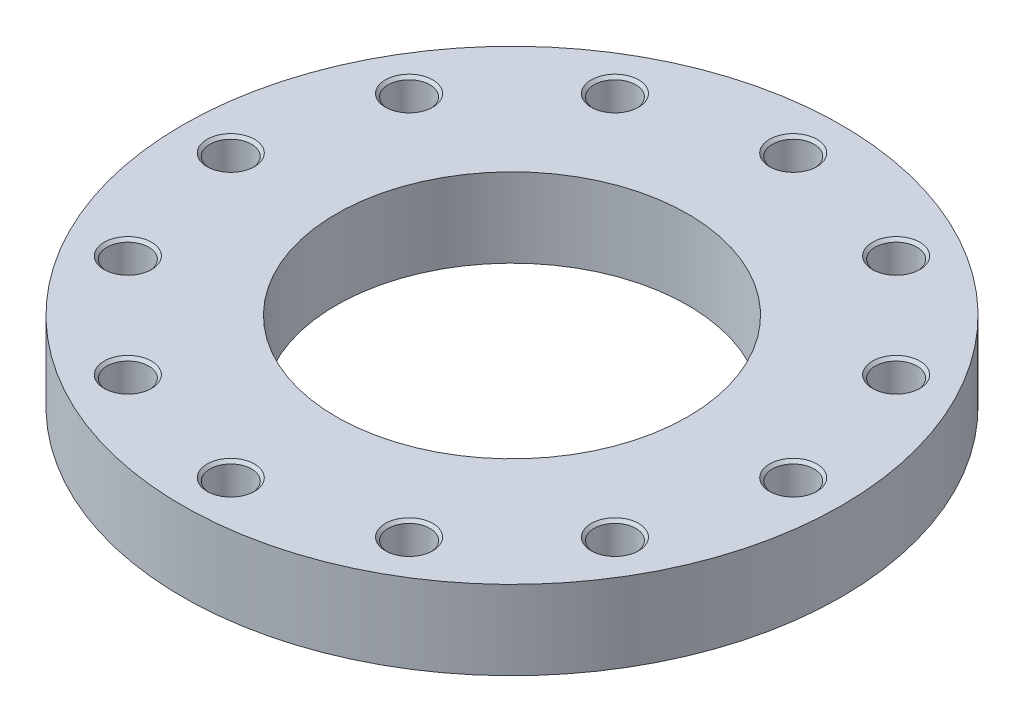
ISO-10303-21;
HEADER;
FILE_DESCRIPTION(('STEP AP214'),'2;1');
FILE_NAME('part.step','',(''),(''),'','','');
FILE_SCHEMA(('AUTOMOTIVE_DESIGN { 1 0 10303 214 1 1 1 1 }'));
ENDSEC;
DATA;
#1=APPLICATION_CONTEXT('core data for automotive mechanical design processes');
#2=APPLICATION_PROTOCOL_DEFINITION('international standard','automotive_design',2000,#1);
#3=PRODUCT_CONTEXT('',#1,'mechanical');
#4=PRODUCT('Part','Part','',(#3));
#5=PRODUCT_RELATED_PRODUCT_CATEGORY('part','',(#4));
#6=PRODUCT_DEFINITION_FORMATION('','',#4);
#7=PRODUCT_DEFINITION_CONTEXT('part definition',#1,'design');
#8=PRODUCT_DEFINITION('design','',#6,#7);
#9=PRODUCT_DEFINITION_SHAPE('','',#8);
#10=(LENGTH_UNIT() NAMED_UNIT(*) SI_UNIT(.MILLI.,.METRE.));
#11=(NAMED_UNIT(*) PLANE_ANGLE_UNIT() SI_UNIT($,.RADIAN.));
#12=(NAMED_UNIT(*) SI_UNIT($,.STERADIAN.) SOLID_ANGLE_UNIT());
#13=UNCERTAINTY_MEASURE_WITH_UNIT(LENGTH_MEASURE(1.E-05),#10,'distance_accuracy_value','');
#14=(GEOMETRIC_REPRESENTATION_CONTEXT(3) GLOBAL_UNCERTAINTY_ASSIGNED_CONTEXT((#13)) GLOBAL_UNIT_ASSIGNED_CONTEXT((#10,
#11,#12)) REPRESENTATION_CONTEXT('',''));
#15=CARTESIAN_POINT('',(0.,0.,0.));
#16=DIRECTION('',(0.,0.,1.));
#17=DIRECTION('',(1.,0.,0.));
#18=AXIS2_PLACEMENT_3D('',#15,#16,#17);
#19=CARTESIAN_POINT('',(0.,22.5,0.));
#20=DIRECTION('',(0.,-1.,0.));
#21=DIRECTION('',(1.,0.,0.));
#22=AXIS2_PLACEMENT_3D('',#19,#20,#21);
#23=CYLINDRICAL_SURFACE('',#22,187.5);
#24=CARTESIAN_POINT('',(0.,0.,0.));
#25=DIRECTION('',(0.,1.,0.));
#26=DIRECTION('',(1.,0.,0.));
#27=AXIS2_PLACEMENT_3D('',#24,#25,#26);
#28=CIRCLE('',#27,187.5);
#29=CARTESIAN_POINT('',(187.5,0.,0.));
#30=VERTEX_POINT('',#29);
#31=EDGE_CURVE('E9',#30,#30,#28,.T.);
#32=ORIENTED_EDGE('',*,*,#31,.T.);
#33=EDGE_LOOP('',(#32));
#34=FACE_BOUND('',#33,.T.);
#35=CARTESIAN_POINT('',(0.,45.,0.));
#36=DIRECTION('',(0.,1.,0.));
#37=DIRECTION('',(1.,0.,0.));
#38=AXIS2_PLACEMENT_3D('',#35,#36,#37);
#39=CIRCLE('',#38,187.5);
#40=CARTESIAN_POINT('',(187.5,45.,0.));
#41=VERTEX_POINT('',#40);
#42=EDGE_CURVE('E340',#41,#41,#39,.T.);
#43=ORIENTED_EDGE('',*,*,#42,.F.);
#44=EDGE_LOOP('',(#43));
#45=FACE_BOUND('',#44,.T.);
#46=ADVANCED_FACE('F15',(#34,#45),#23,.T.);
#47=CARTESIAN_POINT('',(143.75,0.,0.));
#48=DIRECTION('',(0.,-1.,0.));
#49=DIRECTION('',(-1.,0.,0.));
#50=AXIS2_PLACEMENT_3D('',#47,#48,#49);
#51=PLANE('',#50);
#52=CARTESIAN_POINT('',(0.,0.,0.));
#53=DIRECTION('',(0.,1.,0.));
#54=DIRECTION('',(1.,0.,0.));
#55=AXIS2_PLACEMENT_3D('',#52,#53,#54);
#56=CIRCLE('',#55,100.);
#57=CARTESIAN_POINT('',(100.,0.,0.));
#58=VERTEX_POINT('',#57);
#59=EDGE_CURVE('E25',#58,#58,#56,.T.);
#60=ORIENTED_EDGE('',*,*,#59,.T.);
#61=EDGE_LOOP('',(#60));
#62=FACE_BOUND('',#61,.T.);
#63=ORIENTED_EDGE('',*,*,#31,.F.);
#64=EDGE_LOOP('',(#63));
#65=FACE_BOUND('',#64,.T.);
#66=ADVANCED_FACE('F469',(#62,#65),#51,.T.);
#67=CARTESIAN_POINT('',(0.,22.5,0.));
#68=DIRECTION('',(0.,-1.,0.));
#69=DIRECTION('',(1.,0.,0.));
#70=AXIS2_PLACEMENT_3D('',#67,#68,#69);
#71=CYLINDRICAL_SURFACE('',#70,100.);
#72=CARTESIAN_POINT('',(0.,45.,0.));
#73=DIRECTION('',(0.,1.,0.));
#74=DIRECTION('',(1.,0.,0.));
#75=AXIS2_PLACEMENT_3D('',#72,#73,#74);
#76=CIRCLE('',#75,100.);
#77=CARTESIAN_POINT('',(100.,45.,0.));
#78=VERTEX_POINT('',#77);
#79=EDGE_CURVE('E177',#78,#78,#76,.T.);
#80=ORIENTED_EDGE('',*,*,#79,.T.);
#81=EDGE_LOOP('',(#80));
#82=FACE_BOUND('',#81,.T.);
#83=ORIENTED_EDGE('',*,*,#59,.F.);
#84=EDGE_LOOP('',(#83));
#85=FACE_BOUND('',#84,.T.);
#86=ADVANCED_FACE('F474',(#82,#85),#71,.F.);
#87=CARTESIAN_POINT('',(143.75,45.,0.));
#88=DIRECTION('',(0.,1.,0.));
#89=DIRECTION('',(1.,0.,0.));
#90=AXIS2_PLACEMENT_3D('',#87,#88,#89);
#91=PLANE('',#90);
#92=ORIENTED_EDGE('',*,*,#42,.T.);
#93=EDGE_LOOP('',(#92));
#94=FACE_BOUND('',#93,.T.);
#95=ORIENTED_EDGE('',*,*,#79,.F.);
#96=EDGE_LOOP('',(#95));
#97=FACE_BOUND('',#96,.T.);
#98=CARTESIAN_POINT('',(160.,45.,0.));
#99=DIRECTION('',(0.,-1.,0.));
#100=DIRECTION('',(1.,0.,0.));
#101=AXIS2_PLACEMENT_3D('',#98,#99,#100);
#102=CIRCLE('',#101,13.5);
#103=CARTESIAN_POINT('',(173.5,45.,0.));
#104=VERTEX_POINT('',#103);
#105=EDGE_CURVE('E405',#104,#104,#102,.T.);
#106=ORIENTED_EDGE('',*,*,#105,.T.);
#107=EDGE_LOOP('',(#106));
#108=FACE_BOUND('',#107,.T.);
#109=CARTESIAN_POINT('',(138.56406460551,45.,-80.));
#110=DIRECTION('',(0.,-1.,0.));
#111=DIRECTION('',(0.866025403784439,0.,-0.5));
#112=AXIS2_PLACEMENT_3D('',#109,#110,#111);
#113=CIRCLE('',#112,13.5);
#114=CARTESIAN_POINT('',(150.2554075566,45.,-86.75));
#115=VERTEX_POINT('',#114);
#116=EDGE_CURVE('E356',#115,#115,#113,.T.);
#117=ORIENTED_EDGE('',*,*,#116,.T.);
#118=EDGE_LOOP('',(#117));
#119=FACE_BOUND('',#118,.T.);
#120=CARTESIAN_POINT('',(80.,45.,-138.56406460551));
#121=DIRECTION('',(0.,-1.,0.));
#122=DIRECTION('',(0.5,0.,-0.866025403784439));
#123=AXIS2_PLACEMENT_3D('',#120,#121,#122);
#124=CIRCLE('',#123,13.5);
#125=CARTESIAN_POINT('',(86.75,45.,-150.2554075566));
#126=VERTEX_POINT('',#125);
#127=EDGE_CURVE('E363',#126,#126,#124,.T.);
#128=ORIENTED_EDGE('',*,*,#127,.T.);
#129=EDGE_LOOP('',(#128));
#130=FACE_BOUND('',#129,.T.);
#131=CARTESIAN_POINT('',(0.,45.,-160.));
#132=DIRECTION('',(0.,-1.,0.));
#133=DIRECTION('',(0.,0.,-1.));
#134=AXIS2_PLACEMENT_3D('',#131,#132,#133);
#135=CIRCLE('',#134,13.5);
#136=CARTESIAN_POINT('',(0.,45.,-173.5));
#137=VERTEX_POINT('',#136);
#138=EDGE_CURVE('E273',#137,#137,#135,.T.);
#139=ORIENTED_EDGE('',*,*,#138,.T.);
#140=EDGE_LOOP('',(#139));
#141=FACE_BOUND('',#140,.T.);
#142=CARTESIAN_POINT('',(-80.,45.,-138.56406460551));
#143=DIRECTION('',(0.,-1.,0.));
#144=DIRECTION('',(-0.5,0.,-0.866025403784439));
#145=AXIS2_PLACEMENT_3D('',#142,#143,#144);
#146=CIRCLE('',#145,13.5);
#147=CARTESIAN_POINT('',(-86.75,45.,-150.2554075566));
#148=VERTEX_POINT('',#147);
#149=EDGE_CURVE('E302',#148,#148,#146,.T.);
#150=ORIENTED_EDGE('',*,*,#149,.T.);
#151=EDGE_LOOP('',(#150));
#152=FACE_BOUND('',#151,.T.);
#153=CARTESIAN_POINT('',(-138.56406460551,45.,-80.));
#154=DIRECTION('',(0.,-1.,0.));
#155=DIRECTION('',(-0.866025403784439,0.,-0.5));
#156=AXIS2_PLACEMENT_3D('',#153,#154,#155);
#157=CIRCLE('',#156,13.5);
#158=CARTESIAN_POINT('',(-150.2554075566,45.,-86.75));
#159=VERTEX_POINT('',#158);
#160=EDGE_CURVE('E306',#159,#159,#157,.T.);
#161=ORIENTED_EDGE('',*,*,#160,.T.);
#162=EDGE_LOOP('',(#161));
#163=FACE_BOUND('',#162,.T.);
#164=CARTESIAN_POINT('',(-160.,45.,0.));
#165=DIRECTION('',(0.,-1.,0.));
#166=DIRECTION('',(-1.,0.,0.));
#167=AXIS2_PLACEMENT_3D('',#164,#165,#166);
#168=CIRCLE('',#167,13.5);
#169=CARTESIAN_POINT('',(-173.5,45.,0.));
#170=VERTEX_POINT('',#169);
#171=EDGE_CURVE('E294',#170,#170,#168,.T.);
#172=ORIENTED_EDGE('',*,*,#171,.T.);
#173=EDGE_LOOP('',(#172));
#174=FACE_BOUND('',#173,.T.);
#175=CARTESIAN_POINT('',(-138.56406460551,45.,80.));
#176=DIRECTION('',(0.,-1.,0.));
#177=DIRECTION('',(-0.866025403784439,0.,0.5));
#178=AXIS2_PLACEMENT_3D('',#175,#176,#177);
#179=CIRCLE('',#178,13.5);
#180=CARTESIAN_POINT('',(-150.2554075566,45.,86.75));
#181=VERTEX_POINT('',#180);
#182=EDGE_CURVE('E361',#181,#181,#179,.T.);
#183=ORIENTED_EDGE('',*,*,#182,.T.);
#184=EDGE_LOOP('',(#183));
#185=FACE_BOUND('',#184,.T.);
#186=CARTESIAN_POINT('',(-80.,45.,138.56406460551));
#187=DIRECTION('',(0.,-1.,0.));
#188=DIRECTION('',(-0.5,0.,0.866025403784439));
#189=AXIS2_PLACEMENT_3D('',#186,#187,#188);
#190=CIRCLE('',#189,13.5);
#191=CARTESIAN_POINT('',(-86.75,45.,150.2554075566));
#192=VERTEX_POINT('',#191);
#193=EDGE_CURVE('E315',#192,#192,#190,.T.);
#194=ORIENTED_EDGE('',*,*,#193,.T.);
#195=EDGE_LOOP('',(#194));
#196=FACE_BOUND('',#195,.T.);
#197=CARTESIAN_POINT('',(0.,45.,160.));
#198=DIRECTION('',(0.,-1.,0.));
#199=DIRECTION('',(0.,0.,1.));
#200=AXIS2_PLACEMENT_3D('',#197,#198,#199);
#201=CIRCLE('',#200,13.5);
#202=CARTESIAN_POINT('',(0.,45.,173.5));
#203=VERTEX_POINT('',#202);
#204=EDGE_CURVE('E75',#203,#203,#201,.T.);
#205=ORIENTED_EDGE('',*,*,#204,.T.);
#206=EDGE_LOOP('',(#205));
#207=FACE_BOUND('',#206,.T.);
#208=CARTESIAN_POINT('',(80.,45.,138.56406460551));
#209=DIRECTION('',(0.,-1.,0.));
#210=DIRECTION('',(0.5,0.,0.866025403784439));
#211=AXIS2_PLACEMENT_3D('',#208,#209,#210);
#212=CIRCLE('',#211,13.5);
#213=CARTESIAN_POINT('',(86.75,45.,150.2554075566));
#214=VERTEX_POINT('',#213);
#215=EDGE_CURVE('E382',#214,#214,#212,.T.);
#216=ORIENTED_EDGE('',*,*,#215,.T.);
#217=EDGE_LOOP('',(#216));
#218=FACE_BOUND('',#217,.T.);
#219=CARTESIAN_POINT('',(138.56406460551,45.,80.));
#220=DIRECTION('',(0.,-1.,0.));
#221=DIRECTION('',(0.866025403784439,0.,0.5));
#222=AXIS2_PLACEMENT_3D('',#219,#220,#221);
#223=CIRCLE('',#222,13.5);
#224=CARTESIAN_POINT('',(150.2554075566,45.,86.75));
#225=VERTEX_POINT('',#224);
#226=EDGE_CURVE('E381',#225,#225,#223,.T.);
#227=ORIENTED_EDGE('',*,*,#226,.T.);
#228=EDGE_LOOP('',(#227));
#229=FACE_BOUND('',#228,.T.);
#230=ADVANCED_FACE('F274',(#94,#97,#108,#119,#130,#141,#152,#163,#174,#185,#196,#207,#218,#229),
#91,.T.);
#231=CARTESIAN_POINT('',(160.,5.57162193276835,0.));
#232=DIRECTION('',(0.,1.,0.));
#233=DIRECTION('',(1.,0.,0.));
#234=AXIS2_PLACEMENT_3D('',#231,#232,#233);
#235=CONICAL_SURFACE('',#234,5.938125,1.0471975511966);
#236=CARTESIAN_POINT('',(160.,9.,0.));
#237=DIRECTION('',(0.,-1.,0.));
#238=DIRECTION('',(1.,0.,0.));
#239=AXIS2_PLACEMENT_3D('',#236,#237,#238);
#240=CIRCLE('',#239,11.87625);
#241=CARTESIAN_POINT('',(171.87625,9.,0.));
#242=VERTEX_POINT('',#241);
#243=EDGE_CURVE('E184',#242,#242,#240,.T.);
#244=ORIENTED_EDGE('',*,*,#243,.F.);
#245=EDGE_LOOP('',(#244));
#246=FACE_BOUND('',#245,.T.);
#247=CARTESIAN_POINT('',(160.,2.1432438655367,0.));
#248=VERTEX_POINT('',#247);
#249=VERTEX_LOOP('',#248);
#250=FACE_BOUND('',#249,.T.);
#251=ADVANCED_FACE('F1006',(#246,#250),#235,.F.);
#252=CARTESIAN_POINT('',(160.,13.688125,0.));
#253=DIRECTION('',(0.,1.,0.));
#254=DIRECTION('',(1.,0.,0.));
#255=AXIS2_PLACEMENT_3D('',#252,#253,#254);
#256=CYLINDRICAL_SURFACE('',#255,11.87625);
#257=CARTESIAN_POINT('',(160.,18.37625,0.));
#258=DIRECTION('',(0.,-1.,0.));
#259=DIRECTION('',(1.,0.,0.));
#260=AXIS2_PLACEMENT_3D('',#257,#258,#259);
#261=CIRCLE('',#260,11.87625);
#262=CARTESIAN_POINT('',(171.87625,18.37625,0.));
#263=VERTEX_POINT('',#262);
#264=EDGE_CURVE('E312',#263,#263,#261,.T.);
#265=ORIENTED_EDGE('',*,*,#264,.F.);
#266=EDGE_LOOP('',(#265));
#267=FACE_BOUND('',#266,.T.);
#268=ORIENTED_EDGE('',*,*,#243,.T.);
#269=EDGE_LOOP('',(#268));
#270=FACE_BOUND('',#269,.T.);
#271=ADVANCED_FACE('F1002',(#267,#270),#256,.F.);
#272=CARTESIAN_POINT('',(160.,19.188125,0.));
#273=DIRECTION('',(0.,1.,0.));
#274=DIRECTION('',(1.,0.,0.));
#275=AXIS2_PLACEMENT_3D('',#272,#273,#274);
#276=CONICAL_SURFACE('',#275,12.688125,0.785398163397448);
#277=CARTESIAN_POINT('',(160.,20.,0.));
#278=DIRECTION('',(0.,-1.,0.));
#279=DIRECTION('',(1.,0.,0.));
#280=AXIS2_PLACEMENT_3D('',#277,#278,#279);
#281=CIRCLE('',#280,13.5);
#282=CARTESIAN_POINT('',(173.5,20.,0.));
#283=VERTEX_POINT('',#282);
#284=EDGE_CURVE('E314',#283,#283,#281,.T.);
#285=ORIENTED_EDGE('',*,*,#284,.F.);
#286=EDGE_LOOP('',(#285));
#287=FACE_BOUND('',#286,.T.);
#288=ORIENTED_EDGE('',*,*,#264,.T.);
#289=EDGE_LOOP('',(#288));
#290=FACE_BOUND('',#289,.T.);
#291=ADVANCED_FACE('F1005',(#287,#290),#276,.F.);
#292=CARTESIAN_POINT('',(172.688125,20.,0.));
#293=DIRECTION('',(0.,1.,0.));
#294=DIRECTION('',(-1.,0.,0.));
#295=AXIS2_PLACEMENT_3D('',#292,#293,#294);
#296=PLANE('',#295);
#297=CARTESIAN_POINT('',(160.,20.,0.));
#298=DIRECTION('',(0.,-1.,0.));
#299=DIRECTION('',(1.,0.,0.));
#300=AXIS2_PLACEMENT_3D('',#297,#298,#299);
#301=CIRCLE('',#300,11.87625);
#302=CARTESIAN_POINT('',(171.87625,20.,0.));
#303=VERTEX_POINT('',#302);
#304=EDGE_CURVE('E328',#303,#303,#301,.T.);
#305=ORIENTED_EDGE('',*,*,#304,.F.);
#306=EDGE_LOOP('',(#305));
#307=FACE_BOUND('',#306,.T.);
#308=ORIENTED_EDGE('',*,*,#284,.T.);
#309=EDGE_LOOP('',(#308));
#310=FACE_BOUND('',#309,.T.);
#311=ADVANCED_FACE('F480',(#307,#310),#296,.F.);
#312=CARTESIAN_POINT('',(160.,31.688125,0.));
#313=DIRECTION('',(0.,1.,0.));
#314=DIRECTION('',(1.,0.,0.));
#315=AXIS2_PLACEMENT_3D('',#312,#313,#314);
#316=CYLINDRICAL_SURFACE('',#315,11.87625);
#317=CARTESIAN_POINT('',(160.,43.37625,0.));
#318=DIRECTION('',(0.,-1.,0.));
#319=DIRECTION('',(1.,0.,0.));
#320=AXIS2_PLACEMENT_3D('',#317,#318,#319);
#321=CIRCLE('',#320,11.87625);
#322=CARTESIAN_POINT('',(171.87625,43.37625,0.));
#323=VERTEX_POINT('',#322);
#324=EDGE_CURVE('E286',#323,#323,#321,.T.);
#325=ORIENTED_EDGE('',*,*,#324,.F.);
#326=EDGE_LOOP('',(#325));
#327=FACE_BOUND('',#326,.T.);
#328=ORIENTED_EDGE('',*,*,#304,.T.);
#329=EDGE_LOOP('',(#328));
#330=FACE_BOUND('',#329,.T.);
#331=ADVANCED_FACE('F514',(#327,#330),#316,.F.);
#332=CARTESIAN_POINT('',(160.,44.188125,0.));
#333=DIRECTION('',(0.,1.,0.));
#334=DIRECTION('',(1.,0.,0.));
#335=AXIS2_PLACEMENT_3D('',#332,#333,#334);
#336=CONICAL_SURFACE('',#335,12.688125,0.785398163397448);
#337=ORIENTED_EDGE('',*,*,#105,.F.);
#338=EDGE_LOOP('',(#337));
#339=FACE_BOUND('',#338,.T.);
#340=ORIENTED_EDGE('',*,*,#324,.T.);
#341=EDGE_LOOP('',(#340));
#342=FACE_BOUND('',#341,.T.);
#343=ADVANCED_FACE('F517',(#339,#342),#336,.F.);
#344=CARTESIAN_POINT('',(138.56406460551,5.57162193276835,-80.));
#345=DIRECTION('',(0.,1.,0.));
#346=DIRECTION('',(0.866025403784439,0.,-0.5));
#347=AXIS2_PLACEMENT_3D('',#344,#345,#346);
#348=CONICAL_SURFACE('',#347,5.938125,1.0471975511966);
#349=CARTESIAN_POINT('',(138.56406460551,9.,-80.));
#350=DIRECTION('',(0.,-1.,0.));
#351=DIRECTION('',(0.866025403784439,0.,-0.5));
#352=AXIS2_PLACEMENT_3D('',#349,#350,#351);
#353=CIRCLE('',#352,11.87625);
#354=CARTESIAN_POINT('',(148.849198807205,9.,-85.938125));
#355=VERTEX_POINT('',#354);
#356=EDGE_CURVE('E320',#355,#355,#353,.T.);
#357=ORIENTED_EDGE('',*,*,#356,.F.);
#358=EDGE_LOOP('',(#357));
#359=FACE_BOUND('',#358,.T.);
#360=CARTESIAN_POINT('',(138.56406460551,2.1432438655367,-80.));
#361=VERTEX_POINT('',#360);
#362=VERTEX_LOOP('',#361);
#363=FACE_BOUND('',#362,.T.);
#364=ADVANCED_FACE('F578',(#359,#363),#348,.F.);
#365=CARTESIAN_POINT('',(138.56406460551,13.688125,-80.));
#366=DIRECTION('',(0.,1.,0.));
#367=DIRECTION('',(0.866025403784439,0.,-0.5));
#368=AXIS2_PLACEMENT_3D('',#365,#366,#367);
#369=CYLINDRICAL_SURFACE('',#368,11.87625);
#370=CARTESIAN_POINT('',(138.56406460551,18.37625,-80.));
#371=DIRECTION('',(0.,-1.,0.));
#372=DIRECTION('',(0.866025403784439,0.,-0.5));
#373=AXIS2_PLACEMENT_3D('',#370,#371,#372);
#374=CIRCLE('',#373,11.87625);
#375=CARTESIAN_POINT('',(148.849198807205,18.37625,-85.938125));
#376=VERTEX_POINT('',#375);
#377=EDGE_CURVE('E318',#376,#376,#374,.T.);
#378=ORIENTED_EDGE('',*,*,#377,.F.);
#379=EDGE_LOOP('',(#378));
#380=FACE_BOUND('',#379,.T.);
#381=ORIENTED_EDGE('',*,*,#356,.T.);
#382=EDGE_LOOP('',(#381));
#383=FACE_BOUND('',#382,.T.);
#384=ADVANCED_FACE('F17',(#380,#383),#369,.F.);
#385=CARTESIAN_POINT('',(138.56406460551,19.188125,-80.));
#386=DIRECTION('',(0.,1.,0.));
#387=DIRECTION('',(0.866025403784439,0.,-0.5));
#388=AXIS2_PLACEMENT_3D('',#385,#386,#387);
#389=CONICAL_SURFACE('',#388,12.688125,0.785398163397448);
#390=CARTESIAN_POINT('',(138.56406460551,20.,-80.));
#391=DIRECTION('',(0.,-1.,0.));
#392=DIRECTION('',(0.866025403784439,0.,-0.5));
#393=AXIS2_PLACEMENT_3D('',#390,#391,#392);
#394=CIRCLE('',#393,13.5);
#395=CARTESIAN_POINT('',(150.2554075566,20.,-86.75));
#396=VERTEX_POINT('',#395);
#397=EDGE_CURVE('E321',#396,#396,#394,.T.);
#398=ORIENTED_EDGE('',*,*,#397,.F.);
#399=EDGE_LOOP('',(#398));
#400=FACE_BOUND('',#399,.T.);
#401=ORIENTED_EDGE('',*,*,#377,.T.);
#402=EDGE_LOOP('',(#401));
#403=FACE_BOUND('',#402,.T.);
#404=ADVANCED_FACE('F569',(#400,#403),#389,.F.);
#405=CARTESIAN_POINT('',(149.552303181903,20.,-86.3440625));
#406=DIRECTION('',(0.,1.,0.));
#407=DIRECTION('',(-0.866025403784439,0.,0.5));
#408=AXIS2_PLACEMENT_3D('',#405,#406,#407);
#409=PLANE('',#408);
#410=CARTESIAN_POINT('',(138.56406460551,20.,-80.));
#411=DIRECTION('',(0.,-1.,0.));
#412=DIRECTION('',(0.866025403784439,0.,-0.5));
#413=AXIS2_PLACEMENT_3D('',#410,#411,#412);
#414=CIRCLE('',#413,11.87625);
#415=CARTESIAN_POINT('',(148.849198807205,20.,-85.938125));
#416=VERTEX_POINT('',#415);
#417=EDGE_CURVE('E422',#416,#416,#414,.T.);
#418=ORIENTED_EDGE('',*,*,#417,.F.);
#419=EDGE_LOOP('',(#418));
#420=FACE_BOUND('',#419,.T.);
#421=ORIENTED_EDGE('',*,*,#397,.T.);
#422=EDGE_LOOP('',(#421));
#423=FACE_BOUND('',#422,.T.);
#424=ADVANCED_FACE('F567',(#420,#423),#409,.F.);
#425=CARTESIAN_POINT('',(138.56406460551,31.688125,-80.));
#426=DIRECTION('',(0.,1.,0.));
#427=DIRECTION('',(0.866025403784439,0.,-0.5));
#428=AXIS2_PLACEMENT_3D('',#425,#426,#427);
#429=CYLINDRICAL_SURFACE('',#428,11.87625);
#430=CARTESIAN_POINT('',(138.56406460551,43.37625,-80.));
#431=DIRECTION('',(0.,-1.,0.));
#432=DIRECTION('',(0.866025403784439,0.,-0.5));
#433=AXIS2_PLACEMENT_3D('',#430,#431,#432);
#434=CIRCLE('',#433,11.87625);
#435=CARTESIAN_POINT('',(148.849198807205,43.37625,-85.938125));
#436=VERTEX_POINT('',#435);
#437=EDGE_CURVE('E353',#436,#436,#434,.T.);
#438=ORIENTED_EDGE('',*,*,#437,.F.);
#439=EDGE_LOOP('',(#438));
#440=FACE_BOUND('',#439,.T.);
#441=ORIENTED_EDGE('',*,*,#417,.T.);
#442=EDGE_LOOP('',(#441));
#443=FACE_BOUND('',#442,.T.);
#444=ADVANCED_FACE('F564',(#440,#443),#429,.F.);
#445=CARTESIAN_POINT('',(138.56406460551,44.188125,-80.));
#446=DIRECTION('',(0.,1.,0.));
#447=DIRECTION('',(0.866025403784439,0.,-0.5));
#448=AXIS2_PLACEMENT_3D('',#445,#446,#447);
#449=CONICAL_SURFACE('',#448,12.688125,0.785398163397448);
#450=ORIENTED_EDGE('',*,*,#116,.F.);
#451=EDGE_LOOP('',(#450));
#452=FACE_BOUND('',#451,.T.);
#453=ORIENTED_EDGE('',*,*,#437,.T.);
#454=EDGE_LOOP('',(#453));
#455=FACE_BOUND('',#454,.T.);
#456=ADVANCED_FACE('F566',(#452,#455),#449,.F.);
#457=CARTESIAN_POINT('',(80.,5.57162193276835,-138.56406460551));
#458=DIRECTION('',(0.,1.,0.));
#459=DIRECTION('',(0.5,0.,-0.866025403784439));
#460=AXIS2_PLACEMENT_3D('',#457,#458,#459);
#461=CONICAL_SURFACE('',#460,5.938125,1.0471975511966);
#462=CARTESIAN_POINT('',(80.,9.,-138.56406460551));
#463=DIRECTION('',(0.,-1.,0.));
#464=DIRECTION('',(0.5,0.,-0.866025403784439));
#465=AXIS2_PLACEMENT_3D('',#462,#463,#464);
#466=CIRCLE('',#465,11.87625);
#467=CARTESIAN_POINT('',(85.938125,9.,-148.849198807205));
#468=VERTEX_POINT('',#467);
#469=EDGE_CURVE('E357',#468,#468,#466,.T.);
#470=ORIENTED_EDGE('',*,*,#469,.F.);
#471=EDGE_LOOP('',(#470));
#472=FACE_BOUND('',#471,.T.);
#473=CARTESIAN_POINT('',(80.,2.1432438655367,-138.56406460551));
#474=VERTEX_POINT('',#473);
#475=VERTEX_LOOP('',#474);
#476=FACE_BOUND('',#475,.T.);
#477=ADVANCED_FACE('F542',(#472,#476),#461,.F.);
#478=CARTESIAN_POINT('',(80.,13.688125,-138.56406460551));
#479=DIRECTION('',(0.,1.,0.));
#480=DIRECTION('',(0.5,0.,-0.866025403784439));
#481=AXIS2_PLACEMENT_3D('',#478,#479,#480);
#482=CYLINDRICAL_SURFACE('',#481,11.87625);
#483=CARTESIAN_POINT('',(80.,18.37625,-138.56406460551));
#484=DIRECTION('',(0.,-1.,0.));
#485=DIRECTION('',(0.5,0.,-0.866025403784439));
#486=AXIS2_PLACEMENT_3D('',#483,#484,#485);
#487=CIRCLE('',#486,11.87625);
#488=CARTESIAN_POINT('',(85.938125,18.37625,-148.849198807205));
#489=VERTEX_POINT('',#488);
#490=EDGE_CURVE('E348',#489,#489,#487,.T.);
#491=ORIENTED_EDGE('',*,*,#490,.F.);
#492=EDGE_LOOP('',(#491));
#493=FACE_BOUND('',#492,.T.);
#494=ORIENTED_EDGE('',*,*,#469,.T.);
#495=EDGE_LOOP('',(#494));
#496=FACE_BOUND('',#495,.T.);
#497=ADVANCED_FACE('F492',(#493,#496),#482,.F.);
#498=CARTESIAN_POINT('',(80.,19.188125,-138.56406460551));
#499=DIRECTION('',(0.,1.,0.));
#500=DIRECTION('',(0.5,0.,-0.866025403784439));
#501=AXIS2_PLACEMENT_3D('',#498,#499,#500);
#502=CONICAL_SURFACE('',#501,12.688125,0.785398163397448);
#503=CARTESIAN_POINT('',(80.,20.,-138.56406460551));
#504=DIRECTION('',(0.,-1.,0.));
#505=DIRECTION('',(0.5,0.,-0.866025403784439));
#506=AXIS2_PLACEMENT_3D('',#503,#504,#505);
#507=CIRCLE('',#506,13.5);
#508=CARTESIAN_POINT('',(86.75,20.,-150.2554075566));
#509=VERTEX_POINT('',#508);
#510=EDGE_CURVE('E345',#509,#509,#507,.T.);
#511=ORIENTED_EDGE('',*,*,#510,.F.);
#512=EDGE_LOOP('',(#511));
#513=FACE_BOUND('',#512,.T.);
#514=ORIENTED_EDGE('',*,*,#490,.T.);
#515=EDGE_LOOP('',(#514));
#516=FACE_BOUND('',#515,.T.);
#517=ADVANCED_FACE('F488',(#513,#516),#502,.F.);
#518=CARTESIAN_POINT('',(86.3440625,20.,-149.552303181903));
#519=DIRECTION('',(0.,1.,0.));
#520=DIRECTION('',(-0.5,0.,0.866025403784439));
#521=AXIS2_PLACEMENT_3D('',#518,#519,#520);
#522=PLANE('',#521);
#523=CARTESIAN_POINT('',(80.,20.,-138.56406460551));
#524=DIRECTION('',(0.,-1.,0.));
#525=DIRECTION('',(0.5,0.,-0.866025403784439));
#526=AXIS2_PLACEMENT_3D('',#523,#524,#525);
#527=CIRCLE('',#526,11.87625);
#528=CARTESIAN_POINT('',(85.938125,20.,-148.849198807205));
#529=VERTEX_POINT('',#528);
#530=EDGE_CURVE('E349',#529,#529,#527,.T.);
#531=ORIENTED_EDGE('',*,*,#530,.F.);
#532=EDGE_LOOP('',(#531));
#533=FACE_BOUND('',#532,.T.);
#534=ORIENTED_EDGE('',*,*,#510,.T.);
#535=EDGE_LOOP('',(#534));
#536=FACE_BOUND('',#535,.T.);
#537=ADVANCED_FACE('F491',(#533,#536),#522,.F.);
#538=CARTESIAN_POINT('',(80.,31.688125,-138.56406460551));
#539=DIRECTION('',(0.,1.,0.));
#540=DIRECTION('',(0.5,0.,-0.866025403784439));
#541=AXIS2_PLACEMENT_3D('',#538,#539,#540);
#542=CYLINDRICAL_SURFACE('',#541,11.87625);
#543=CARTESIAN_POINT('',(80.,43.37625,-138.56406460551));
#544=DIRECTION('',(0.,-1.,0.));
#545=DIRECTION('',(0.5,0.,-0.866025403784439));
#546=AXIS2_PLACEMENT_3D('',#543,#544,#545);
#547=CIRCLE('',#546,11.87625);
#548=CARTESIAN_POINT('',(85.938125,43.37625,-148.849198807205));
#549=VERTEX_POINT('',#548);
#550=EDGE_CURVE('E332',#549,#549,#547,.T.);
#551=ORIENTED_EDGE('',*,*,#550,.F.);
#552=EDGE_LOOP('',(#551));
#553=FACE_BOUND('',#552,.T.);
#554=ORIENTED_EDGE('',*,*,#530,.T.);
#555=EDGE_LOOP('',(#554));
#556=FACE_BOUND('',#555,.T.);
#557=ADVANCED_FACE('F512',(#553,#556),#542,.F.);
#558=CARTESIAN_POINT('',(80.,44.188125,-138.56406460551));
#559=DIRECTION('',(0.,1.,0.));
#560=DIRECTION('',(0.5,0.,-0.866025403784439));
#561=AXIS2_PLACEMENT_3D('',#558,#559,#560);
#562=CONICAL_SURFACE('',#561,12.688125,0.785398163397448);
#563=ORIENTED_EDGE('',*,*,#127,.F.);
#564=EDGE_LOOP('',(#563));
#565=FACE_BOUND('',#564,.T.);
#566=ORIENTED_EDGE('',*,*,#550,.T.);
#567=EDGE_LOOP('',(#566));
#568=FACE_BOUND('',#567,.T.);
#569=ADVANCED_FACE('F623',(#565,#568),#562,.F.);
#570=CARTESIAN_POINT('',(0.,5.57162193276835,-160.));
#571=DIRECTION('',(0.,1.,0.));
#572=DIRECTION('',(0.,0.,-1.));
#573=AXIS2_PLACEMENT_3D('',#570,#571,#572);
#574=CONICAL_SURFACE('',#573,5.938125,1.0471975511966);
#575=CARTESIAN_POINT('',(0.,9.,-160.));
#576=DIRECTION('',(0.,-1.,0.));
#577=DIRECTION('',(0.,0.,-1.));
#578=AXIS2_PLACEMENT_3D('',#575,#576,#577);
#579=CIRCLE('',#578,11.87625);
#580=CARTESIAN_POINT('',(0.,9.,-171.87625));
#581=VERTEX_POINT('',#580);
#582=EDGE_CURVE('E330',#581,#581,#579,.T.);
#583=ORIENTED_EDGE('',*,*,#582,.F.);
#584=EDGE_LOOP('',(#583));
#585=FACE_BOUND('',#584,.T.);
#586=CARTESIAN_POINT('',(0.,2.1432438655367,-160.));
#587=VERTEX_POINT('',#586);
#588=VERTEX_LOOP('',#587);
#589=FACE_BOUND('',#588,.T.);
#590=ADVANCED_FACE('F621',(#585,#589),#574,.F.);
#591=CARTESIAN_POINT('',(0.,13.688125,-160.));
#592=DIRECTION('',(0.,1.,0.));
#593=DIRECTION('',(0.,0.,-1.));
#594=AXIS2_PLACEMENT_3D('',#591,#592,#593);
#595=CYLINDRICAL_SURFACE('',#594,11.87625);
#596=CARTESIAN_POINT('',(0.,18.37625,-160.));
#597=DIRECTION('',(0.,-1.,0.));
#598=DIRECTION('',(0.,0.,-1.));
#599=AXIS2_PLACEMENT_3D('',#596,#597,#598);
#600=CIRCLE('',#599,11.87625);
#601=CARTESIAN_POINT('',(0.,18.37625,-171.87625));
#602=VERTEX_POINT('',#601);
#603=EDGE_CURVE('E333',#602,#602,#600,.T.);
#604=ORIENTED_EDGE('',*,*,#603,.F.);
#605=EDGE_LOOP('',(#604));
#606=FACE_BOUND('',#605,.T.);
#607=ORIENTED_EDGE('',*,*,#582,.T.);
#608=EDGE_LOOP('',(#607));
#609=FACE_BOUND('',#608,.T.);
#610=ADVANCED_FACE('F498',(#606,#609),#595,.F.);
#611=CARTESIAN_POINT('',(0.,19.188125,-160.));
#612=DIRECTION('',(0.,1.,0.));
#613=DIRECTION('',(0.,0.,-1.));
#614=AXIS2_PLACEMENT_3D('',#611,#612,#613);
#615=CONICAL_SURFACE('',#614,12.688125,0.785398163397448);
#616=CARTESIAN_POINT('',(0.,20.,-160.));
#617=DIRECTION('',(0.,-1.,0.));
#618=DIRECTION('',(0.,0.,-1.));
#619=AXIS2_PLACEMENT_3D('',#616,#617,#618);
#620=CIRCLE('',#619,13.5);
#621=CARTESIAN_POINT('',(0.,20.,-173.5));
#622=VERTEX_POINT('',#621);
#623=EDGE_CURVE('E280',#622,#622,#620,.T.);
#624=ORIENTED_EDGE('',*,*,#623,.F.);
#625=EDGE_LOOP('',(#624));
#626=FACE_BOUND('',#625,.T.);
#627=ORIENTED_EDGE('',*,*,#603,.T.);
#628=EDGE_LOOP('',(#627));
#629=FACE_BOUND('',#628,.T.);
#630=ADVANCED_FACE('F494',(#626,#629),#615,.F.);
#631=CARTESIAN_POINT('',(0.,20.,-172.688125));
#632=DIRECTION('',(0.,1.,0.));
#633=DIRECTION('',(0.,0.,1.));
#634=AXIS2_PLACEMENT_3D('',#631,#632,#633);
#635=PLANE('',#634);
#636=CARTESIAN_POINT('',(0.,20.,-160.));
#637=DIRECTION('',(0.,-1.,0.));
#638=DIRECTION('',(0.,0.,-1.));
#639=AXIS2_PLACEMENT_3D('',#636,#637,#638);
#640=CIRCLE('',#639,11.87625);
#641=CARTESIAN_POINT('',(0.,20.,-171.87625));
#642=VERTEX_POINT('',#641);
#643=EDGE_CURVE('E277',#642,#642,#640,.T.);
#644=ORIENTED_EDGE('',*,*,#643,.F.);
#645=EDGE_LOOP('',(#644));
#646=FACE_BOUND('',#645,.T.);
#647=ORIENTED_EDGE('',*,*,#623,.T.);
#648=EDGE_LOOP('',(#647));
#649=FACE_BOUND('',#648,.T.);
#650=ADVANCED_FACE('F497',(#646,#649),#635,.F.);
#651=CARTESIAN_POINT('',(0.,31.688125,-160.));
#652=DIRECTION('',(0.,1.,0.));
#653=DIRECTION('',(0.,0.,-1.));
#654=AXIS2_PLACEMENT_3D('',#651,#652,#653);
#655=CYLINDRICAL_SURFACE('',#654,11.87625);
#656=CARTESIAN_POINT('',(0.,43.37625,-160.));
#657=DIRECTION('',(0.,-1.,0.));
#658=DIRECTION('',(0.,0.,-1.));
#659=AXIS2_PLACEMENT_3D('',#656,#657,#658);
#660=CIRCLE('',#659,11.87625);
#661=CARTESIAN_POINT('',(0.,43.37625,-171.87625));
#662=VERTEX_POINT('',#661);
#663=EDGE_CURVE('E278',#662,#662,#660,.T.);
#664=ORIENTED_EDGE('',*,*,#663,.F.);
#665=EDGE_LOOP('',(#664));
#666=FACE_BOUND('',#665,.T.);
#667=ORIENTED_EDGE('',*,*,#643,.T.);
#668=EDGE_LOOP('',(#667));
#669=FACE_BOUND('',#668,.T.);
#670=ADVANCED_FACE('F935',(#666,#669),#655,.F.);
#671=CARTESIAN_POINT('',(0.,44.188125,-160.));
#672=DIRECTION('',(0.,1.,0.));
#673=DIRECTION('',(0.,0.,-1.));
#674=AXIS2_PLACEMENT_3D('',#671,#672,#673);
#675=CONICAL_SURFACE('',#674,12.688125,0.785398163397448);
#676=ORIENTED_EDGE('',*,*,#138,.F.);
#677=EDGE_LOOP('',(#676));
#678=FACE_BOUND('',#677,.T.);
#679=ORIENTED_EDGE('',*,*,#663,.T.);
#680=EDGE_LOOP('',(#679));
#681=FACE_BOUND('',#680,.T.);
#682=ADVANCED_FACE('F932',(#678,#681),#675,.F.);
#683=CARTESIAN_POINT('',(-80.,5.57162193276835,-138.56406460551));
#684=DIRECTION('',(0.,1.,0.));
#685=DIRECTION('',(-0.5,0.,-0.866025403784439));
#686=AXIS2_PLACEMENT_3D('',#683,#684,#685);
#687=CONICAL_SURFACE('',#686,5.938125,1.0471975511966);
#688=CARTESIAN_POINT('',(-80.,9.,-138.56406460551));
#689=DIRECTION('',(0.,-1.,0.));
#690=DIRECTION('',(-0.5,0.,-0.866025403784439));
#691=AXIS2_PLACEMENT_3D('',#688,#689,#690);
#692=CIRCLE('',#691,11.87625);
#693=CARTESIAN_POINT('',(-85.938125,9.,-148.849198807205));
#694=VERTEX_POINT('',#693);
#695=EDGE_CURVE('E282',#694,#694,#692,.T.);
#696=ORIENTED_EDGE('',*,*,#695,.F.);
#697=EDGE_LOOP('',(#696));
#698=FACE_BOUND('',#697,.T.);
#699=CARTESIAN_POINT('',(-80.,2.1432438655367,-138.56406460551));
#700=VERTEX_POINT('',#699);
#701=VERTEX_LOOP('',#700);
#702=FACE_BOUND('',#701,.T.);
#703=ADVANCED_FACE('F934',(#698,#702),#687,.F.);
#704=CARTESIAN_POINT('',(-80.,13.688125,-138.56406460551));
#705=DIRECTION('',(0.,1.,0.));
#706=DIRECTION('',(-0.5,0.,-0.866025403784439));
#707=AXIS2_PLACEMENT_3D('',#704,#705,#706);
#708=CYLINDRICAL_SURFACE('',#707,11.87625);
#709=CARTESIAN_POINT('',(-80.,18.37625,-138.56406460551));
#710=DIRECTION('',(0.,-1.,0.));
#711=DIRECTION('',(-0.5,0.,-0.866025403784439));
#712=AXIS2_PLACEMENT_3D('',#709,#710,#711);
#713=CIRCLE('',#712,11.87625);
#714=CARTESIAN_POINT('',(-85.938125,18.37625,-148.849198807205));
#715=VERTEX_POINT('',#714);
#716=EDGE_CURVE('E350',#715,#715,#713,.T.);
#717=ORIENTED_EDGE('',*,*,#716,.F.);
#718=EDGE_LOOP('',(#717));
#719=FACE_BOUND('',#718,.T.);
#720=ORIENTED_EDGE('',*,*,#695,.T.);
#721=EDGE_LOOP('',(#720));
#722=FACE_BOUND('',#721,.T.);
#723=ADVANCED_FACE('F952',(#719,#722),#708,.F.);
#724=CARTESIAN_POINT('',(-80.,19.188125,-138.56406460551));
#725=DIRECTION('',(0.,1.,0.));
#726=DIRECTION('',(-0.5,0.,-0.866025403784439));
#727=AXIS2_PLACEMENT_3D('',#724,#725,#726);
#728=CONICAL_SURFACE('',#727,12.688125,0.785398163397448);
#729=CARTESIAN_POINT('',(-80.,20.,-138.56406460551));
#730=DIRECTION('',(0.,-1.,0.));
#731=DIRECTION('',(-0.5,0.,-0.866025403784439));
#732=AXIS2_PLACEMENT_3D('',#729,#730,#731);
#733=CIRCLE('',#732,13.5);
#734=CARTESIAN_POINT('',(-86.75,20.,-150.2554075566));
#735=VERTEX_POINT('',#734);
#736=EDGE_CURVE('E336',#735,#735,#733,.T.);
#737=ORIENTED_EDGE('',*,*,#736,.F.);
#738=EDGE_LOOP('',(#737));
#739=FACE_BOUND('',#738,.T.);
#740=ORIENTED_EDGE('',*,*,#716,.T.);
#741=EDGE_LOOP('',(#740));
#742=FACE_BOUND('',#741,.T.);
#743=ADVANCED_FACE('F943',(#739,#742),#728,.F.);
#744=CARTESIAN_POINT('',(-86.3440625,20.,-149.552303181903));
#745=DIRECTION('',(0.,1.,0.));
#746=DIRECTION('',(0.5,0.,0.866025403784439));
#747=AXIS2_PLACEMENT_3D('',#744,#745,#746);
#748=PLANE('',#747);
#749=CARTESIAN_POINT('',(-80.,20.,-138.56406460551));
#750=DIRECTION('',(0.,-1.,0.));
#751=DIRECTION('',(-0.5,0.,-0.866025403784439));
#752=AXIS2_PLACEMENT_3D('',#749,#750,#751);
#753=CIRCLE('',#752,11.87625);
#754=CARTESIAN_POINT('',(-85.938125,20.,-148.849198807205));
#755=VERTEX_POINT('',#754);
#756=EDGE_CURVE('E334',#755,#755,#753,.T.);
#757=ORIENTED_EDGE('',*,*,#756,.F.);
#758=EDGE_LOOP('',(#757));
#759=FACE_BOUND('',#758,.T.);
#760=ORIENTED_EDGE('',*,*,#736,.T.);
#761=EDGE_LOOP('',(#760));
#762=FACE_BOUND('',#761,.T.);
#763=ADVANCED_FACE('F940',(#759,#762),#748,.F.);
#764=CARTESIAN_POINT('',(-80.,31.688125,-138.56406460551));
#765=DIRECTION('',(0.,1.,0.));
#766=DIRECTION('',(-0.5,0.,-0.866025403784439));
#767=AXIS2_PLACEMENT_3D('',#764,#765,#766);
#768=CYLINDRICAL_SURFACE('',#767,11.87625);
#769=CARTESIAN_POINT('',(-80.,43.37625,-138.56406460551));
#770=DIRECTION('',(0.,-1.,0.));
#771=DIRECTION('',(-0.5,0.,-0.866025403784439));
#772=AXIS2_PLACEMENT_3D('',#769,#770,#771);
#773=CIRCLE('',#772,11.87625);
#774=CARTESIAN_POINT('',(-85.938125,43.37625,-148.849198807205));
#775=VERTEX_POINT('',#774);
#776=EDGE_CURVE('E299',#775,#775,#773,.T.);
#777=ORIENTED_EDGE('',*,*,#776,.F.);
#778=EDGE_LOOP('',(#777));
#779=FACE_BOUND('',#778,.T.);
#780=ORIENTED_EDGE('',*,*,#756,.T.);
#781=EDGE_LOOP('',(#780));
#782=FACE_BOUND('',#781,.T.);
#783=ADVANCED_FACE('F942',(#779,#782),#768,.F.);
#784=CARTESIAN_POINT('',(-80.,44.188125,-138.56406460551));
#785=DIRECTION('',(0.,1.,0.));
#786=DIRECTION('',(-0.5,0.,-0.866025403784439));
#787=AXIS2_PLACEMENT_3D('',#784,#785,#786);
#788=CONICAL_SURFACE('',#787,12.688125,0.785398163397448);
#789=ORIENTED_EDGE('',*,*,#149,.F.);
#790=EDGE_LOOP('',(#789));
#791=FACE_BOUND('',#790,.T.);
#792=ORIENTED_EDGE('',*,*,#776,.T.);
#793=EDGE_LOOP('',(#792));
#794=FACE_BOUND('',#793,.T.);
#795=ADVANCED_FACE('F949',(#791,#794),#788,.F.);
#796=CARTESIAN_POINT('',(-138.56406460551,5.57162193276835,-80.));
#797=DIRECTION('',(0.,1.,0.));
#798=DIRECTION('',(-0.866025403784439,0.,-0.5));
#799=AXIS2_PLACEMENT_3D('',#796,#797,#798);
#800=CONICAL_SURFACE('',#799,5.938125,1.0471975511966);
#801=CARTESIAN_POINT('',(-138.56406460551,9.,-80.));
#802=DIRECTION('',(0.,-1.,0.));
#803=DIRECTION('',(-0.866025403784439,0.,-0.5));
#804=AXIS2_PLACEMENT_3D('',#801,#802,#803);
#805=CIRCLE('',#804,11.87625);
#806=CARTESIAN_POINT('',(-148.849198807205,9.,-85.9381250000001));
#807=VERTEX_POINT('',#806);
#808=EDGE_CURVE('E303',#807,#807,#805,.T.);
#809=ORIENTED_EDGE('',*,*,#808,.F.);
#810=EDGE_LOOP('',(#809));
#811=FACE_BOUND('',#810,.T.);
#812=CARTESIAN_POINT('',(-138.56406460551,2.1432438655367,-80.));
#813=VERTEX_POINT('',#812);
#814=VERTEX_LOOP('',#813);
#815=FACE_BOUND('',#814,.T.);
#816=ADVANCED_FACE('F985',(#811,#815),#800,.F.);
#817=CARTESIAN_POINT('',(-138.56406460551,13.688125,-80.));
#818=DIRECTION('',(0.,1.,0.));
#819=DIRECTION('',(-0.866025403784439,0.,-0.5));
#820=AXIS2_PLACEMENT_3D('',#817,#818,#819);
#821=CYLINDRICAL_SURFACE('',#820,11.87625);
#822=CARTESIAN_POINT('',(-138.56406460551,18.37625,-80.));
#823=DIRECTION('',(0.,-1.,0.));
#824=DIRECTION('',(-0.866025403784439,0.,-0.5));
#825=AXIS2_PLACEMENT_3D('',#822,#823,#824);
#826=CIRCLE('',#825,11.87625);
#827=CARTESIAN_POINT('',(-148.849198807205,18.37625,-85.9381250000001));
#828=VERTEX_POINT('',#827);
#829=EDGE_CURVE('E19',#828,#828,#826,.T.);
#830=ORIENTED_EDGE('',*,*,#829,.F.);
#831=EDGE_LOOP('',(#830));
#832=FACE_BOUND('',#831,.T.);
#833=ORIENTED_EDGE('',*,*,#808,.T.);
#834=EDGE_LOOP('',(#833));
#835=FACE_BOUND('',#834,.T.);
#836=ADVANCED_FACE('F562',(#832,#835),#821,.F.);
#837=CARTESIAN_POINT('',(-138.56406460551,19.188125,-80.));
#838=DIRECTION('',(0.,1.,0.));
#839=DIRECTION('',(-0.866025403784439,0.,-0.5));
#840=AXIS2_PLACEMENT_3D('',#837,#838,#839);
#841=CONICAL_SURFACE('',#840,12.688125,0.785398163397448);
#842=CARTESIAN_POINT('',(-138.56406460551,20.,-80.));
#843=DIRECTION('',(0.,-1.,0.));
#844=DIRECTION('',(-0.866025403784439,0.,-0.5));
#845=AXIS2_PLACEMENT_3D('',#842,#843,#844);
#846=CIRCLE('',#845,13.5);
#847=CARTESIAN_POINT('',(-150.2554075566,20.,-86.75));
#848=VERTEX_POINT('',#847);
#849=EDGE_CURVE('E367',#848,#848,#846,.T.);
#850=ORIENTED_EDGE('',*,*,#849,.F.);
#851=EDGE_LOOP('',(#850));
#852=FACE_BOUND('',#851,.T.);
#853=ORIENTED_EDGE('',*,*,#829,.T.);
#854=EDGE_LOOP('',(#853));
#855=FACE_BOUND('',#854,.T.);
#856=ADVANCED_FACE('F534',(#852,#855),#841,.F.);
#857=CARTESIAN_POINT('',(-149.552303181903,20.,-86.3440625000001));
#858=DIRECTION('',(0.,1.,0.));
#859=DIRECTION('',(0.866025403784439,0.,0.5));
#860=AXIS2_PLACEMENT_3D('',#857,#858,#859);
#861=PLANE('',#860);
#862=CARTESIAN_POINT('',(-138.56406460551,20.,-80.));
#863=DIRECTION('',(0.,-1.,0.));
#864=DIRECTION('',(-0.866025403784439,0.,-0.5));
#865=AXIS2_PLACEMENT_3D('',#862,#863,#864);
#866=CIRCLE('',#865,11.87625);
#867=CARTESIAN_POINT('',(-148.849198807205,20.,-85.9381250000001));
#868=VERTEX_POINT('',#867);
#869=EDGE_CURVE('E338',#868,#868,#866,.T.);
#870=ORIENTED_EDGE('',*,*,#869,.F.);
#871=EDGE_LOOP('',(#870));
#872=FACE_BOUND('',#871,.T.);
#873=ORIENTED_EDGE('',*,*,#849,.T.);
#874=EDGE_LOOP('',(#873));
#875=FACE_BOUND('',#874,.T.);
#876=ADVANCED_FACE('F531',(#872,#875),#861,.F.);
#877=CARTESIAN_POINT('',(-138.56406460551,31.688125,-80.));
#878=DIRECTION('',(0.,1.,0.));
#879=DIRECTION('',(-0.866025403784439,0.,-0.5));
#880=AXIS2_PLACEMENT_3D('',#877,#878,#879);
#881=CYLINDRICAL_SURFACE('',#880,11.87625);
#882=CARTESIAN_POINT('',(-138.56406460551,43.37625,-80.));
#883=DIRECTION('',(0.,-1.,0.));
#884=DIRECTION('',(-0.866025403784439,0.,-0.5));
#885=AXIS2_PLACEMENT_3D('',#882,#883,#884);
#886=CIRCLE('',#885,11.87625);
#887=CARTESIAN_POINT('',(-148.849198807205,43.37625,-85.9381250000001));
#888=VERTEX_POINT('',#887);
#889=EDGE_CURVE('E304',#888,#888,#886,.T.);
#890=ORIENTED_EDGE('',*,*,#889,.F.);
#891=EDGE_LOOP('',(#890));
#892=FACE_BOUND('',#891,.T.);
#893=ORIENTED_EDGE('',*,*,#869,.T.);
#894=EDGE_LOOP('',(#893));
#895=FACE_BOUND('',#894,.T.);
#896=ADVANCED_FACE('F508',(#892,#895),#881,.F.);
#897=CARTESIAN_POINT('',(-138.56406460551,44.188125,-80.));
#898=DIRECTION('',(0.,1.,0.));
#899=DIRECTION('',(-0.866025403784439,0.,-0.5));
#900=AXIS2_PLACEMENT_3D('',#897,#898,#899);
#901=CONICAL_SURFACE('',#900,12.688125,0.785398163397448);
#902=ORIENTED_EDGE('',*,*,#160,.F.);
#903=EDGE_LOOP('',(#902));
#904=FACE_BOUND('',#903,.T.);
#905=ORIENTED_EDGE('',*,*,#889,.T.);
#906=EDGE_LOOP('',(#905));
#907=FACE_BOUND('',#906,.T.);
#908=ADVANCED_FACE('F504',(#904,#907),#901,.F.);
#909=CARTESIAN_POINT('',(-160.,5.57162193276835,0.));
#910=DIRECTION('',(0.,1.,0.));
#911=DIRECTION('',(-1.,0.,0.));
#912=AXIS2_PLACEMENT_3D('',#909,#910,#911);
#913=CONICAL_SURFACE('',#912,5.938125,1.0471975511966);
#914=CARTESIAN_POINT('',(-160.,9.,0.));
#915=DIRECTION('',(0.,-1.,0.));
#916=DIRECTION('',(-1.,0.,0.));
#917=AXIS2_PLACEMENT_3D('',#914,#915,#916);
#918=CIRCLE('',#917,11.87625);
#919=CARTESIAN_POINT('',(-171.87625,9.,0.));
#920=VERTEX_POINT('',#919);
#921=EDGE_CURVE('E307',#920,#920,#918,.T.);
#922=ORIENTED_EDGE('',*,*,#921,.F.);
#923=EDGE_LOOP('',(#922));
#924=FACE_BOUND('',#923,.T.);
#925=CARTESIAN_POINT('',(-160.,2.1432438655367,0.));
#926=VERTEX_POINT('',#925);
#927=VERTEX_LOOP('',#926);
#928=FACE_BOUND('',#927,.T.);
#929=ADVANCED_FACE('F507',(#924,#928),#913,.F.);
#930=CARTESIAN_POINT('',(-160.,13.688125,0.));
#931=DIRECTION('',(0.,1.,0.));
#932=DIRECTION('',(-1.,0.,0.));
#933=AXIS2_PLACEMENT_3D('',#930,#931,#932);
#934=CYLINDRICAL_SURFACE('',#933,11.87625);
#935=CARTESIAN_POINT('',(-160.,18.37625,0.));
#936=DIRECTION('',(0.,-1.,0.));
#937=DIRECTION('',(-1.,0.,0.));
#938=AXIS2_PLACEMENT_3D('',#935,#936,#937);
#939=CIRCLE('',#938,11.87625);
#940=CARTESIAN_POINT('',(-171.87625,18.37625,0.));
#941=VERTEX_POINT('',#940);
#942=EDGE_CURVE('E311',#941,#941,#939,.T.);
#943=ORIENTED_EDGE('',*,*,#942,.F.);
#944=EDGE_LOOP('',(#943));
#945=FACE_BOUND('',#944,.T.);
#946=ORIENTED_EDGE('',*,*,#921,.T.);
#947=EDGE_LOOP('',(#946));
#948=FACE_BOUND('',#947,.T.);
#949=ADVANCED_FACE('F552',(#945,#948),#934,.F.);
#950=CARTESIAN_POINT('',(-160.,19.188125,0.));
#951=DIRECTION('',(0.,1.,0.));
#952=DIRECTION('',(-1.,0.,0.));
#953=AXIS2_PLACEMENT_3D('',#950,#951,#952);
#954=CONICAL_SURFACE('',#953,12.688125,0.785398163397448);
#955=CARTESIAN_POINT('',(-160.,20.,0.));
#956=DIRECTION('',(0.,-1.,0.));
#957=DIRECTION('',(-1.,0.,0.));
#958=AXIS2_PLACEMENT_3D('',#955,#956,#957);
#959=CIRCLE('',#958,13.5);
#960=CARTESIAN_POINT('',(-173.5,20.,0.));
#961=VERTEX_POINT('',#960);
#962=EDGE_CURVE('E293',#961,#961,#959,.T.);
#963=ORIENTED_EDGE('',*,*,#962,.F.);
#964=EDGE_LOOP('',(#963));
#965=FACE_BOUND('',#964,.T.);
#966=ORIENTED_EDGE('',*,*,#942,.T.);
#967=EDGE_LOOP('',(#966));
#968=FACE_BOUND('',#967,.T.);
#969=ADVANCED_FACE('F548',(#965,#968),#954,.F.);
#970=CARTESIAN_POINT('',(-172.688125,20.,0.));
#971=DIRECTION('',(0.,1.,0.));
#972=DIRECTION('',(1.,0.,0.));
#973=AXIS2_PLACEMENT_3D('',#970,#971,#972);
#974=PLANE('',#973);
#975=CARTESIAN_POINT('',(-160.,20.,0.));
#976=DIRECTION('',(0.,-1.,0.));
#977=DIRECTION('',(-1.,0.,0.));
#978=AXIS2_PLACEMENT_3D('',#975,#976,#977);
#979=CIRCLE('',#978,11.87625);
#980=CARTESIAN_POINT('',(-171.87625,20.,0.));
#981=VERTEX_POINT('',#980);
#982=EDGE_CURVE('E291',#981,#981,#979,.T.);
#983=ORIENTED_EDGE('',*,*,#982,.F.);
#984=EDGE_LOOP('',(#983));
#985=FACE_BOUND('',#984,.T.);
#986=ORIENTED_EDGE('',*,*,#962,.T.);
#987=EDGE_LOOP('',(#986));
#988=FACE_BOUND('',#987,.T.);
#989=ADVANCED_FACE('F551',(#985,#988),#974,.F.);
#990=CARTESIAN_POINT('',(-160.,31.688125,0.));
#991=DIRECTION('',(0.,1.,0.));
#992=DIRECTION('',(-1.,0.,0.));
#993=AXIS2_PLACEMENT_3D('',#990,#991,#992);
#994=CYLINDRICAL_SURFACE('',#993,11.87625);
#995=CARTESIAN_POINT('',(-160.,43.37625,0.));
#996=DIRECTION('',(0.,-1.,0.));
#997=DIRECTION('',(-1.,0.,0.));
#998=AXIS2_PLACEMENT_3D('',#995,#996,#997);
#999=CIRCLE('',#998,11.87625);
#1000=CARTESIAN_POINT('',(-171.87625,43.37625,0.));
#1001=VERTEX_POINT('',#1000);
#1002=EDGE_CURVE('E342',#1001,#1001,#999,.T.);
#1003=ORIENTED_EDGE('',*,*,#1002,.F.);
#1004=EDGE_LOOP('',(#1003));
#1005=FACE_BOUND('',#1004,.T.);
#1006=ORIENTED_EDGE('',*,*,#982,.T.);
#1007=EDGE_LOOP('',(#1006));
#1008=FACE_BOUND('',#1007,.T.);
#1009=ADVANCED_FACE('F463',(#1005,#1008),#994,.F.);
#1010=CARTESIAN_POINT('',(-160.,44.188125,0.));
#1011=DIRECTION('',(0.,1.,0.));
#1012=DIRECTION('',(-1.,0.,0.));
#1013=AXIS2_PLACEMENT_3D('',#1010,#1011,#1012);
#1014=CONICAL_SURFACE('',#1013,12.688125,0.785398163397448);
#1015=ORIENTED_EDGE('',*,*,#171,.F.);
#1016=EDGE_LOOP('',(#1015));
#1017=FACE_BOUND('',#1016,.T.);
#1018=ORIENTED_EDGE('',*,*,#1002,.T.);
#1019=EDGE_LOOP('',(#1018));
#1020=FACE_BOUND('',#1019,.T.);
#1021=ADVANCED_FACE('F457',(#1017,#1020),#1014,.F.);
#1022=CARTESIAN_POINT('',(-138.56406460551,5.57162193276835,80.));
#1023=DIRECTION('',(0.,1.,0.));
#1024=DIRECTION('',(-0.866025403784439,0.,0.5));
#1025=AXIS2_PLACEMENT_3D('',#1022,#1023,#1024);
#1026=CONICAL_SURFACE('',#1025,5.938125,1.0471975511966);
#1027=CARTESIAN_POINT('',(-138.56406460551,9.,80.));
#1028=DIRECTION('',(0.,-1.,0.));
#1029=DIRECTION('',(-0.866025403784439,0.,0.5));
#1030=AXIS2_PLACEMENT_3D('',#1027,#1028,#1029);
#1031=CIRCLE('',#1030,11.87625);
#1032=CARTESIAN_POINT('',(-148.849198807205,9.,85.938125));
#1033=VERTEX_POINT('',#1032);
#1034=EDGE_CURVE('E344',#1033,#1033,#1031,.T.);
#1035=ORIENTED_EDGE('',*,*,#1034,.F.);
#1036=EDGE_LOOP('',(#1035));
#1037=FACE_BOUND('',#1036,.T.);
#1038=CARTESIAN_POINT('',(-138.56406460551,2.1432438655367,80.));
#1039=VERTEX_POINT('',#1038);
#1040=VERTEX_LOOP('',#1039);
#1041=FACE_BOUND('',#1040,.T.);
#1042=ADVANCED_FACE('F450',(#1037,#1041),#1026,.F.);
#1043=CARTESIAN_POINT('',(-138.56406460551,13.688125,80.));
#1044=DIRECTION('',(0.,1.,0.));
#1045=DIRECTION('',(-0.866025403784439,0.,0.5));
#1046=AXIS2_PLACEMENT_3D('',#1043,#1044,#1045);
#1047=CYLINDRICAL_SURFACE('',#1046,11.87625);
#1048=CARTESIAN_POINT('',(-138.56406460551,18.37625,80.));
#1049=DIRECTION('',(0.,-1.,0.));
#1050=DIRECTION('',(-0.866025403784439,0.,0.5));
#1051=AXIS2_PLACEMENT_3D('',#1048,#1049,#1050);
#1052=CIRCLE('',#1051,11.87625);
#1053=CARTESIAN_POINT('',(-148.849198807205,18.37625,85.938125));
#1054=VERTEX_POINT('',#1053);
#1055=EDGE_CURVE('E396',#1054,#1054,#1052,.T.);
#1056=ORIENTED_EDGE('',*,*,#1055,.F.);
#1057=EDGE_LOOP('',(#1056));
#1058=FACE_BOUND('',#1057,.T.);
#1059=ORIENTED_EDGE('',*,*,#1034,.T.);
#1060=EDGE_LOOP('',(#1059));
#1061=FACE_BOUND('',#1060,.T.);
#1062=ADVANCED_FACE('F444',(#1058,#1061),#1047,.F.);
#1063=CARTESIAN_POINT('',(-138.56406460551,19.188125,80.));
#1064=DIRECTION('',(0.,1.,0.));
#1065=DIRECTION('',(-0.866025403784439,0.,0.5));
#1066=AXIS2_PLACEMENT_3D('',#1063,#1064,#1065);
#1067=CONICAL_SURFACE('',#1066,12.688125,0.785398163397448);
#1068=CARTESIAN_POINT('',(-138.56406460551,20.,80.));
#1069=DIRECTION('',(0.,-1.,0.));
#1070=DIRECTION('',(-0.866025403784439,0.,0.5));
#1071=AXIS2_PLACEMENT_3D('',#1068,#1069,#1070);
#1072=CIRCLE('',#1071,13.5);
#1073=CARTESIAN_POINT('',(-150.2554075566,20.,86.75));
#1074=VERTEX_POINT('',#1073);
#1075=EDGE_CURVE('E398',#1074,#1074,#1072,.T.);
#1076=ORIENTED_EDGE('',*,*,#1075,.F.);
#1077=EDGE_LOOP('',(#1076));
#1078=FACE_BOUND('',#1077,.T.);
#1079=ORIENTED_EDGE('',*,*,#1055,.T.);
#1080=EDGE_LOOP('',(#1079));
#1081=FACE_BOUND('',#1080,.T.);
#1082=ADVANCED_FACE('F441',(#1078,#1081),#1067,.F.);
#1083=CARTESIAN_POINT('',(-149.552303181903,20.,86.3440625));
#1084=DIRECTION('',(0.,1.,0.));
#1085=DIRECTION('',(0.866025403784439,0.,-0.5));
#1086=AXIS2_PLACEMENT_3D('',#1083,#1084,#1085);
#1087=PLANE('',#1086);
#1088=CARTESIAN_POINT('',(-138.56406460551,20.,80.));
#1089=DIRECTION('',(0.,-1.,0.));
#1090=DIRECTION('',(-0.866025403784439,0.,0.5));
#1091=AXIS2_PLACEMENT_3D('',#1088,#1089,#1090);
#1092=CIRCLE('',#1091,11.87625);
#1093=CARTESIAN_POINT('',(-148.849198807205,20.,85.938125));
#1094=VERTEX_POINT('',#1093);
#1095=EDGE_CURVE('E378',#1094,#1094,#1092,.T.);
#1096=ORIENTED_EDGE('',*,*,#1095,.F.);
#1097=EDGE_LOOP('',(#1096));
#1098=FACE_BOUND('',#1097,.T.);
#1099=ORIENTED_EDGE('',*,*,#1075,.T.);
#1100=EDGE_LOOP('',(#1099));
#1101=FACE_BOUND('',#1100,.T.);
#1102=ADVANCED_FACE('F439',(#1098,#1101),#1087,.F.);
#1103=CARTESIAN_POINT('',(-138.56406460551,31.688125,80.));
#1104=DIRECTION('',(0.,1.,0.));
#1105=DIRECTION('',(-0.866025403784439,0.,0.5));
#1106=AXIS2_PLACEMENT_3D('',#1103,#1104,#1105);
#1107=CYLINDRICAL_SURFACE('',#1106,11.87625);
#1108=CARTESIAN_POINT('',(-138.56406460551,43.37625,80.));
#1109=DIRECTION('',(0.,-1.,0.));
#1110=DIRECTION('',(-0.866025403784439,0.,0.5));
#1111=AXIS2_PLACEMENT_3D('',#1108,#1109,#1110);
#1112=CIRCLE('',#1111,11.87625);
#1113=CARTESIAN_POINT('',(-148.849198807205,43.37625,85.938125));
#1114=VERTEX_POINT('',#1113);
#1115=EDGE_CURVE('E358',#1114,#1114,#1112,.T.);
#1116=ORIENTED_EDGE('',*,*,#1115,.F.);
#1117=EDGE_LOOP('',(#1116));
#1118=FACE_BOUND('',#1117,.T.);
#1119=ORIENTED_EDGE('',*,*,#1095,.T.);
#1120=EDGE_LOOP('',(#1119));
#1121=FACE_BOUND('',#1120,.T.);
#1122=ADVANCED_FACE('F538',(#1118,#1121),#1107,.F.);
#1123=CARTESIAN_POINT('',(-138.56406460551,44.188125,80.));
#1124=DIRECTION('',(0.,1.,0.));
#1125=DIRECTION('',(-0.866025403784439,0.,0.5));
#1126=AXIS2_PLACEMENT_3D('',#1123,#1124,#1125);
#1127=CONICAL_SURFACE('',#1126,12.688125,0.785398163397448);
#1128=ORIENTED_EDGE('',*,*,#182,.F.);
#1129=EDGE_LOOP('',(#1128));
#1130=FACE_BOUND('',#1129,.T.);
#1131=ORIENTED_EDGE('',*,*,#1115,.T.);
#1132=EDGE_LOOP('',(#1131));
#1133=FACE_BOUND('',#1132,.T.);
#1134=ADVANCED_FACE('F711',(#1130,#1133),#1127,.F.);
#1135=CARTESIAN_POINT('',(-80.,5.57162193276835,138.56406460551));
#1136=DIRECTION('',(0.,1.,0.));
#1137=DIRECTION('',(-0.5,0.,0.866025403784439));
#1138=AXIS2_PLACEMENT_3D('',#1135,#1136,#1137);
#1139=CONICAL_SURFACE('',#1138,5.938125,1.0471975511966);
#1140=CARTESIAN_POINT('',(-80.,9.,138.56406460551));
#1141=DIRECTION('',(0.,-1.,0.));
#1142=DIRECTION('',(-0.5,0.,0.866025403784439));
#1143=AXIS2_PLACEMENT_3D('',#1140,#1141,#1142);
#1144=CIRCLE('',#1143,11.87625);
#1145=CARTESIAN_POINT('',(-85.9381250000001,9.,148.849198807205));
#1146=VERTEX_POINT('',#1145);
#1147=EDGE_CURVE('E289',#1146,#1146,#1144,.T.);
#1148=ORIENTED_EDGE('',*,*,#1147,.F.);
#1149=EDGE_LOOP('',(#1148));
#1150=FACE_BOUND('',#1149,.T.);
#1151=CARTESIAN_POINT('',(-80.,2.1432438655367,138.56406460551));
#1152=VERTEX_POINT('',#1151);
#1153=VERTEX_LOOP('',#1152);
#1154=FACE_BOUND('',#1153,.T.);
#1155=ADVANCED_FACE('F721',(#1150,#1154),#1139,.F.);
#1156=CARTESIAN_POINT('',(-80.,13.688125,138.56406460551));
#1157=DIRECTION('',(0.,1.,0.));
#1158=DIRECTION('',(-0.5,0.,0.866025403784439));
#1159=AXIS2_PLACEMENT_3D('',#1156,#1157,#1158);
#1160=CYLINDRICAL_SURFACE('',#1159,11.87625);
#1161=CARTESIAN_POINT('',(-80.,18.37625,138.56406460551));
#1162=DIRECTION('',(0.,-1.,0.));
#1163=DIRECTION('',(-0.5,0.,0.866025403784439));
#1164=AXIS2_PLACEMENT_3D('',#1161,#1162,#1163);
#1165=CIRCLE('',#1164,11.87625);
#1166=CARTESIAN_POINT('',(-85.9381250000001,18.37625,148.849198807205));
#1167=VERTEX_POINT('',#1166);
#1168=EDGE_CURVE('E287',#1167,#1167,#1165,.T.);
#1169=ORIENTED_EDGE('',*,*,#1168,.F.);
#1170=EDGE_LOOP('',(#1169));
#1171=FACE_BOUND('',#1170,.T.);
#1172=ORIENTED_EDGE('',*,*,#1147,.T.);
#1173=EDGE_LOOP('',(#1172));
#1174=FACE_BOUND('',#1173,.T.);
#1175=ADVANCED_FACE('F619',(#1171,#1174),#1160,.F.);
#1176=CARTESIAN_POINT('',(-80.,19.188125,138.56406460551));
#1177=DIRECTION('',(0.,1.,0.));
#1178=DIRECTION('',(-0.5,0.,0.866025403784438));
#1179=AXIS2_PLACEMENT_3D('',#1176,#1177,#1178);
#1180=CONICAL_SURFACE('',#1179,12.688125,0.785398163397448);
#1181=CARTESIAN_POINT('',(-80.,20.,138.56406460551));
#1182=DIRECTION('',(0.,-1.,0.));
#1183=DIRECTION('',(-0.5,0.,0.866025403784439));
#1184=AXIS2_PLACEMENT_3D('',#1181,#1182,#1183);
#1185=CIRCLE('',#1184,13.5);
#1186=CARTESIAN_POINT('',(-86.75,20.,150.2554075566));
#1187=VERTEX_POINT('',#1186);
#1188=EDGE_CURVE('E290',#1187,#1187,#1185,.T.);
#1189=ORIENTED_EDGE('',*,*,#1188,.F.);
#1190=EDGE_LOOP('',(#1189));
#1191=FACE_BOUND('',#1190,.T.);
#1192=ORIENTED_EDGE('',*,*,#1168,.T.);
#1193=EDGE_LOOP('',(#1192));
#1194=FACE_BOUND('',#1193,.T.);
#1195=ADVANCED_FACE('F616',(#1191,#1194),#1180,.F.);
#1196=CARTESIAN_POINT('',(-86.3440625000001,20.,149.552303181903));
#1197=DIRECTION('',(0.,1.,0.));
#1198=DIRECTION('',(0.5,0.,-0.866025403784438));
#1199=AXIS2_PLACEMENT_3D('',#1196,#1197,#1198);
#1200=PLANE('',#1199);
#1201=CARTESIAN_POINT('',(-80.,20.,138.56406460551));
#1202=DIRECTION('',(0.,-1.,0.));
#1203=DIRECTION('',(-0.5,0.,0.866025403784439));
#1204=AXIS2_PLACEMENT_3D('',#1201,#1202,#1203);
#1205=CIRCLE('',#1204,11.87625);
#1206=CARTESIAN_POINT('',(-85.9381250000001,20.,148.849198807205));
#1207=VERTEX_POINT('',#1206);
#1208=EDGE_CURVE('E317',#1207,#1207,#1205,.T.);
#1209=ORIENTED_EDGE('',*,*,#1208,.F.);
#1210=EDGE_LOOP('',(#1209));
#1211=FACE_BOUND('',#1210,.T.);
#1212=ORIENTED_EDGE('',*,*,#1188,.T.);
#1213=EDGE_LOOP('',(#1212));
#1214=FACE_BOUND('',#1213,.T.);
#1215=ADVANCED_FACE('F529',(#1211,#1214),#1200,.F.);
#1216=CARTESIAN_POINT('',(-80.,31.688125,138.56406460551));
#1217=DIRECTION('',(0.,1.,0.));
#1218=DIRECTION('',(-0.5,0.,0.866025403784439));
#1219=AXIS2_PLACEMENT_3D('',#1216,#1217,#1218);
#1220=CYLINDRICAL_SURFACE('',#1219,11.87625);
#1221=CARTESIAN_POINT('',(-80.,43.37625,138.56406460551));
#1222=DIRECTION('',(0.,-1.,0.));
#1223=DIRECTION('',(-0.5,0.,0.866025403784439));
#1224=AXIS2_PLACEMENT_3D('',#1221,#1222,#1223);
#1225=CIRCLE('',#1224,11.87625);
#1226=CARTESIAN_POINT('',(-85.9381250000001,43.37625,148.849198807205));
#1227=VERTEX_POINT('',#1226);
#1228=EDGE_CURVE('E297',#1227,#1227,#1225,.T.);
#1229=ORIENTED_EDGE('',*,*,#1228,.F.);
#1230=EDGE_LOOP('',(#1229));
#1231=FACE_BOUND('',#1230,.T.);
#1232=ORIENTED_EDGE('',*,*,#1208,.T.);
#1233=EDGE_LOOP('',(#1232));
#1234=FACE_BOUND('',#1233,.T.);
#1235=ADVANCED_FACE('F525',(#1231,#1234),#1220,.F.);
#1236=CARTESIAN_POINT('',(-80.,44.188125,138.56406460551));
#1237=DIRECTION('',(0.,1.,0.));
#1238=DIRECTION('',(-0.5,0.,0.866025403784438));
#1239=AXIS2_PLACEMENT_3D('',#1236,#1237,#1238);
#1240=CONICAL_SURFACE('',#1239,12.688125,0.785398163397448);
#1241=ORIENTED_EDGE('',*,*,#193,.F.);
#1242=EDGE_LOOP('',(#1241));
#1243=FACE_BOUND('',#1242,.T.);
#1244=ORIENTED_EDGE('',*,*,#1228,.T.);
#1245=EDGE_LOOP('',(#1244));
#1246=FACE_BOUND('',#1245,.T.);
#1247=ADVANCED_FACE('F528',(#1243,#1246),#1240,.F.);
#1248=CARTESIAN_POINT('',(0.,5.57162193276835,160.));
#1249=DIRECTION('',(0.,1.,0.));
#1250=DIRECTION('',(0.,0.,1.));
#1251=AXIS2_PLACEMENT_3D('',#1248,#1249,#1250);
#1252=CONICAL_SURFACE('',#1251,5.938125,1.0471975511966);
#1253=CARTESIAN_POINT('',(0.,9.,160.));
#1254=DIRECTION('',(0.,-1.,0.));
#1255=DIRECTION('',(0.,0.,1.));
#1256=AXIS2_PLACEMENT_3D('',#1253,#1254,#1255);
#1257=CIRCLE('',#1256,11.87625);
#1258=CARTESIAN_POINT('',(0.,9.,171.87625));
#1259=VERTEX_POINT('',#1258);
#1260=EDGE_CURVE('E295',#1259,#1259,#1257,.T.);
#1261=ORIENTED_EDGE('',*,*,#1260,.F.);
#1262=EDGE_LOOP('',(#1261));
#1263=FACE_BOUND('',#1262,.T.);
#1264=CARTESIAN_POINT('',(0.,2.1432438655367,160.));
#1265=VERTEX_POINT('',#1264);
#1266=VERTEX_LOOP('',#1265);
#1267=FACE_BOUND('',#1266,.T.);
#1268=ADVANCED_FACE('F546',(#1263,#1267),#1252,.F.);
#1269=CARTESIAN_POINT('',(0.,13.688125,160.));
#1270=DIRECTION('',(0.,1.,0.));
#1271=DIRECTION('',(0.,0.,1.));
#1272=AXIS2_PLACEMENT_3D('',#1269,#1270,#1271);
#1273=CYLINDRICAL_SURFACE('',#1272,11.87625);
#1274=CARTESIAN_POINT('',(0.,18.37625,160.));
#1275=DIRECTION('',(0.,-1.,0.));
#1276=DIRECTION('',(0.,0.,1.));
#1277=AXIS2_PLACEMENT_3D('',#1274,#1275,#1276);
#1278=CIRCLE('',#1277,11.87625);
#1279=CARTESIAN_POINT('',(0.,18.37625,171.87625));
#1280=VERTEX_POINT('',#1279);
#1281=EDGE_CURVE('E298',#1280,#1280,#1278,.T.);
#1282=ORIENTED_EDGE('',*,*,#1281,.F.);
#1283=EDGE_LOOP('',(#1282));
#1284=FACE_BOUND('',#1283,.T.);
#1285=ORIENTED_EDGE('',*,*,#1260,.T.);
#1286=EDGE_LOOP('',(#1285));
#1287=FACE_BOUND('',#1286,.T.);
#1288=ADVANCED_FACE('F776',(#1284,#1287),#1273,.F.);
#1289=CARTESIAN_POINT('',(0.,19.188125,160.));
#1290=DIRECTION('',(0.,1.,0.));
#1291=DIRECTION('',(0.,0.,1.));
#1292=AXIS2_PLACEMENT_3D('',#1289,#1290,#1291);
#1293=CONICAL_SURFACE('',#1292,12.688125,0.785398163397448);
#1294=CARTESIAN_POINT('',(0.,20.,160.));
#1295=DIRECTION('',(0.,-1.,0.));
#1296=DIRECTION('',(0.,0.,1.));
#1297=AXIS2_PLACEMENT_3D('',#1294,#1295,#1296);
#1298=CIRCLE('',#1297,13.5);
#1299=CARTESIAN_POINT('',(0.,20.,173.5));
#1300=VERTEX_POINT('',#1299);
#1301=EDGE_CURVE('E308',#1300,#1300,#1298,.T.);
#1302=ORIENTED_EDGE('',*,*,#1301,.F.);
#1303=EDGE_LOOP('',(#1302));
#1304=FACE_BOUND('',#1303,.T.);
#1305=ORIENTED_EDGE('',*,*,#1281,.T.);
#1306=EDGE_LOOP('',(#1305));
#1307=FACE_BOUND('',#1306,.T.);
#1308=ADVANCED_FACE('F786',(#1304,#1307),#1293,.F.);
#1309=CARTESIAN_POINT('',(0.,20.,172.688125));
#1310=DIRECTION('',(0.,1.,0.));
#1311=DIRECTION('',(0.,0.,-1.));
#1312=AXIS2_PLACEMENT_3D('',#1309,#1310,#1311);
#1313=PLANE('',#1312);
#1314=CARTESIAN_POINT('',(0.,20.,160.));
#1315=DIRECTION('',(0.,-1.,0.));
#1316=DIRECTION('',(0.,0.,1.));
#1317=AXIS2_PLACEMENT_3D('',#1314,#1315,#1316);
#1318=CIRCLE('',#1317,11.87625);
#1319=CARTESIAN_POINT('',(0.,20.,171.87625));
#1320=VERTEX_POINT('',#1319);
#1321=EDGE_CURVE('E67',#1320,#1320,#1318,.T.);
#1322=ORIENTED_EDGE('',*,*,#1321,.F.);
#1323=EDGE_LOOP('',(#1322));
#1324=FACE_BOUND('',#1323,.T.);
#1325=ORIENTED_EDGE('',*,*,#1301,.T.);
#1326=EDGE_LOOP('',(#1325));
#1327=FACE_BOUND('',#1326,.T.);
#1328=ADVANCED_FACE('F796',(#1324,#1327),#1313,.F.);
#1329=CARTESIAN_POINT('',(0.,31.688125,160.));
#1330=DIRECTION('',(0.,1.,0.));
#1331=DIRECTION('',(0.,0.,1.));
#1332=AXIS2_PLACEMENT_3D('',#1329,#1330,#1331);
#1333=CYLINDRICAL_SURFACE('',#1332,11.87625);
#1334=CARTESIAN_POINT('',(0.,43.37625,160.));
#1335=DIRECTION('',(0.,-1.,0.));
#1336=DIRECTION('',(0.,0.,1.));
#1337=AXIS2_PLACEMENT_3D('',#1334,#1335,#1336);
#1338=CIRCLE('',#1337,11.87625);
#1339=CARTESIAN_POINT('',(0.,43.37625,171.87625));
#1340=VERTEX_POINT('',#1339);
#1341=EDGE_CURVE('E325',#1340,#1340,#1338,.T.);
#1342=ORIENTED_EDGE('',*,*,#1341,.F.);
#1343=EDGE_LOOP('',(#1342));
#1344=FACE_BOUND('',#1343,.T.);
#1345=ORIENTED_EDGE('',*,*,#1321,.T.);
#1346=EDGE_LOOP('',(#1345));
#1347=FACE_BOUND('',#1346,.T.);
#1348=ADVANCED_FACE('F806',(#1344,#1347),#1333,.F.);
#1349=CARTESIAN_POINT('',(0.,44.188125,160.));
#1350=DIRECTION('',(0.,1.,0.));
#1351=DIRECTION('',(0.,0.,1.));
#1352=AXIS2_PLACEMENT_3D('',#1349,#1350,#1351);
#1353=CONICAL_SURFACE('',#1352,12.688125,0.785398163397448);
#1354=ORIENTED_EDGE('',*,*,#204,.F.);
#1355=EDGE_LOOP('',(#1354));
#1356=FACE_BOUND('',#1355,.T.);
#1357=ORIENTED_EDGE('',*,*,#1341,.T.);
#1358=EDGE_LOOP('',(#1357));
#1359=FACE_BOUND('',#1358,.T.);
#1360=ADVANCED_FACE('F816',(#1356,#1359),#1353,.F.);
#1361=CARTESIAN_POINT('',(80.,5.57162193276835,138.56406460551));
#1362=DIRECTION('',(0.,1.,0.));
#1363=DIRECTION('',(0.5,0.,0.866025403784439));
#1364=AXIS2_PLACEMENT_3D('',#1361,#1362,#1363);
#1365=CONICAL_SURFACE('',#1364,5.938125,1.0471975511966);
#1366=CARTESIAN_POINT('',(80.,9.,138.56406460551));
#1367=DIRECTION('',(0.,-1.,0.));
#1368=DIRECTION('',(0.5,0.,0.866025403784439));
#1369=AXIS2_PLACEMENT_3D('',#1366,#1367,#1368);
#1370=CIRCLE('',#1369,11.87625);
#1371=CARTESIAN_POINT('',(85.9381249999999,9.,148.849198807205));
#1372=VERTEX_POINT('',#1371);
#1373=EDGE_CURVE('E323',#1372,#1372,#1370,.T.);
#1374=ORIENTED_EDGE('',*,*,#1373,.F.);
#1375=EDGE_LOOP('',(#1374));
#1376=FACE_BOUND('',#1375,.T.);
#1377=CARTESIAN_POINT('',(80.,2.1432438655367,138.56406460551));
#1378=VERTEX_POINT('',#1377);
#1379=VERTEX_LOOP('',#1378);
#1380=FACE_BOUND('',#1379,.T.);
#1381=ADVANCED_FACE('F826',(#1376,#1380),#1365,.F.);
#1382=CARTESIAN_POINT('',(80.,13.688125,138.56406460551));
#1383=DIRECTION('',(0.,1.,0.));
#1384=DIRECTION('',(0.5,0.,0.866025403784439));
#1385=AXIS2_PLACEMENT_3D('',#1382,#1383,#1384);
#1386=CYLINDRICAL_SURFACE('',#1385,11.87625);
#1387=CARTESIAN_POINT('',(80.,18.37625,138.56406460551));
#1388=DIRECTION('',(0.,-1.,0.));
#1389=DIRECTION('',(0.5,0.,0.866025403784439));
#1390=AXIS2_PLACEMENT_3D('',#1387,#1388,#1389);
#1391=CIRCLE('',#1390,11.87625);
#1392=CARTESIAN_POINT('',(85.9381249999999,18.37625,148.849198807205));
#1393=VERTEX_POINT('',#1392);
#1394=EDGE_CURVE('E326',#1393,#1393,#1391,.T.);
#1395=ORIENTED_EDGE('',*,*,#1394,.F.);
#1396=EDGE_LOOP('',(#1395));
#1397=FACE_BOUND('',#1396,.T.);
#1398=ORIENTED_EDGE('',*,*,#1373,.T.);
#1399=EDGE_LOOP('',(#1398));
#1400=FACE_BOUND('',#1399,.T.);
#1401=ADVANCED_FACE('F523',(#1397,#1400),#1386,.F.);
#1402=CARTESIAN_POINT('',(80.,19.188125,138.56406460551));
#1403=DIRECTION('',(0.,1.,0.));
#1404=DIRECTION('',(0.5,0.,0.866025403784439));
#1405=AXIS2_PLACEMENT_3D('',#1402,#1403,#1404);
#1406=CONICAL_SURFACE('',#1405,12.688125,0.785398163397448);
#1407=CARTESIAN_POINT('',(80.,20.,138.56406460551));
#1408=DIRECTION('',(0.,-1.,0.));
#1409=DIRECTION('',(0.5,0.,0.866025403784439));
#1410=AXIS2_PLACEMENT_3D('',#1407,#1408,#1409);
#1411=CIRCLE('',#1410,13.5);
#1412=CARTESIAN_POINT('',(86.75,20.,150.2554075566));
#1413=VERTEX_POINT('',#1412);
#1414=EDGE_CURVE('E368',#1413,#1413,#1411,.T.);
#1415=ORIENTED_EDGE('',*,*,#1414,.F.);
#1416=EDGE_LOOP('',(#1415));
#1417=FACE_BOUND('',#1416,.T.);
#1418=ORIENTED_EDGE('',*,*,#1394,.T.);
#1419=EDGE_LOOP('',(#1418));
#1420=FACE_BOUND('',#1419,.T.);
#1421=ADVANCED_FACE('F519',(#1417,#1420),#1406,.F.);
#1422=CARTESIAN_POINT('',(86.3440624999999,20.,149.552303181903));
#1423=DIRECTION('',(0.,1.,0.));
#1424=DIRECTION('',(-0.5,0.,-0.866025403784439));
#1425=AXIS2_PLACEMENT_3D('',#1422,#1423,#1424);
#1426=PLANE('',#1425);
#1427=CARTESIAN_POINT('',(80.,20.,138.56406460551));
#1428=DIRECTION('',(0.,-1.,0.));
#1429=DIRECTION('',(0.5,0.,0.866025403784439));
#1430=AXIS2_PLACEMENT_3D('',#1427,#1428,#1429);
#1431=CIRCLE('',#1430,11.87625);
#1432=CARTESIAN_POINT('',(85.9381249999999,20.,148.849198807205));
#1433=VERTEX_POINT('',#1432);
#1434=EDGE_CURVE('E371',#1433,#1433,#1431,.T.);
#1435=ORIENTED_EDGE('',*,*,#1434,.F.);
#1436=EDGE_LOOP('',(#1435));
#1437=FACE_BOUND('',#1436,.T.);
#1438=ORIENTED_EDGE('',*,*,#1414,.T.);
#1439=EDGE_LOOP('',(#1438));
#1440=FACE_BOUND('',#1439,.T.);
#1441=ADVANCED_FACE('F522',(#1437,#1440),#1426,.F.);
#1442=CARTESIAN_POINT('',(80.,31.688125,138.56406460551));
#1443=DIRECTION('',(0.,1.,0.));
#1444=DIRECTION('',(0.5,0.,0.866025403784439));
#1445=AXIS2_PLACEMENT_3D('',#1442,#1443,#1444);
#1446=CYLINDRICAL_SURFACE('',#1445,11.87625);
#1447=CARTESIAN_POINT('',(80.,43.37625,138.56406460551));
#1448=DIRECTION('',(0.,-1.,0.));
#1449=DIRECTION('',(0.5,0.,0.866025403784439));
#1450=AXIS2_PLACEMENT_3D('',#1447,#1448,#1449);
#1451=CIRCLE('',#1450,11.87625);
#1452=CARTESIAN_POINT('',(85.9381249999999,43.37625,148.849198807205));
#1453=VERTEX_POINT('',#1452);
#1454=EDGE_CURVE('E383',#1453,#1453,#1451,.T.);
#1455=ORIENTED_EDGE('',*,*,#1454,.F.);
#1456=EDGE_LOOP('',(#1455));
#1457=FACE_BOUND('',#1456,.T.);
#1458=ORIENTED_EDGE('',*,*,#1434,.T.);
#1459=EDGE_LOOP('',(#1458));
#1460=FACE_BOUND('',#1459,.T.);
#1461=ADVANCED_FACE('F558',(#1457,#1460),#1446,.F.);
#1462=CARTESIAN_POINT('',(80.,44.188125,138.56406460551));
#1463=DIRECTION('',(0.,1.,0.));
#1464=DIRECTION('',(0.5,0.,0.866025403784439));
#1465=AXIS2_PLACEMENT_3D('',#1462,#1463,#1464);
#1466=CONICAL_SURFACE('',#1465,12.688125,0.785398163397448);
#1467=ORIENTED_EDGE('',*,*,#215,.F.);
#1468=EDGE_LOOP('',(#1467));
#1469=FACE_BOUND('',#1468,.T.);
#1470=ORIENTED_EDGE('',*,*,#1454,.T.);
#1471=EDGE_LOOP('',(#1470));
#1472=FACE_BOUND('',#1471,.T.);
#1473=ADVANCED_FACE('F554',(#1469,#1472),#1466,.F.);
#1474=CARTESIAN_POINT('',(138.56406460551,5.57162193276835,80.));
#1475=DIRECTION('',(0.,1.,0.));
#1476=DIRECTION('',(0.866025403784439,0.,0.5));
#1477=AXIS2_PLACEMENT_3D('',#1474,#1475,#1476);
#1478=CONICAL_SURFACE('',#1477,5.938125,1.0471975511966);
#1479=CARTESIAN_POINT('',(138.56406460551,9.,80.));
#1480=DIRECTION('',(0.,-1.,0.));
#1481=DIRECTION('',(0.866025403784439,0.,0.5));
#1482=AXIS2_PLACEMENT_3D('',#1479,#1480,#1481);
#1483=CIRCLE('',#1482,11.87625);
#1484=CARTESIAN_POINT('',(148.849198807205,9.,85.9381250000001));
#1485=VERTEX_POINT('',#1484);
#1486=EDGE_CURVE('E374',#1485,#1485,#1483,.T.);
#1487=ORIENTED_EDGE('',*,*,#1486,.F.);
#1488=EDGE_LOOP('',(#1487));
#1489=FACE_BOUND('',#1488,.T.);
#1490=CARTESIAN_POINT('',(138.56406460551,2.1432438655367,80.));
#1491=VERTEX_POINT('',#1490);
#1492=VERTEX_LOOP('',#1491);
#1493=FACE_BOUND('',#1492,.T.);
#1494=ADVANCED_FACE('F557',(#1489,#1493),#1478,.F.);
#1495=CARTESIAN_POINT('',(138.56406460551,13.688125,80.));
#1496=DIRECTION('',(0.,1.,0.));
#1497=DIRECTION('',(0.866025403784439,0.,0.5));
#1498=AXIS2_PLACEMENT_3D('',#1495,#1496,#1497);
#1499=CYLINDRICAL_SURFACE('',#1498,11.87625);
#1500=CARTESIAN_POINT('',(138.56406460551,18.37625,80.));
#1501=DIRECTION('',(0.,-1.,0.));
#1502=DIRECTION('',(0.866025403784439,0.,0.5));
#1503=AXIS2_PLACEMENT_3D('',#1500,#1501,#1502);
#1504=CIRCLE('',#1503,11.87625);
#1505=CARTESIAN_POINT('',(148.849198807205,18.37625,85.9381250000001));
#1506=VERTEX_POINT('',#1505);
#1507=EDGE_CURVE('E372',#1506,#1506,#1504,.T.);
#1508=ORIENTED_EDGE('',*,*,#1507,.F.);
#1509=EDGE_LOOP('',(#1508));
#1510=FACE_BOUND('',#1509,.T.);
#1511=ORIENTED_EDGE('',*,*,#1486,.T.);
#1512=EDGE_LOOP('',(#1511));
#1513=FACE_BOUND('',#1512,.T.);
#1514=ADVANCED_FACE('F884',(#1510,#1513),#1499,.F.);
#1515=CARTESIAN_POINT('',(138.56406460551,19.188125,80.));
#1516=DIRECTION('',(0.,1.,0.));
#1517=DIRECTION('',(0.866025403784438,0.,0.5));
#1518=AXIS2_PLACEMENT_3D('',#1515,#1516,#1517);
#1519=CONICAL_SURFACE('',#1518,12.688125,0.785398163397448);
#1520=CARTESIAN_POINT('',(138.56406460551,20.,80.));
#1521=DIRECTION('',(0.,-1.,0.));
#1522=DIRECTION('',(0.866025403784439,0.,0.5));
#1523=AXIS2_PLACEMENT_3D('',#1520,#1521,#1522);
#1524=CIRCLE('',#1523,13.5);
#1525=CARTESIAN_POINT('',(150.2554075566,20.,86.75));
#1526=VERTEX_POINT('',#1525);
#1527=EDGE_CURVE('E375',#1526,#1526,#1524,.T.);
#1528=ORIENTED_EDGE('',*,*,#1527,.F.);
#1529=EDGE_LOOP('',(#1528));
#1530=FACE_BOUND('',#1529,.T.);
#1531=ORIENTED_EDGE('',*,*,#1507,.T.);
#1532=EDGE_LOOP('',(#1531));
#1533=FACE_BOUND('',#1532,.T.);
#1534=ADVANCED_FACE('F486',(#1530,#1533),#1519,.F.);
#1535=CARTESIAN_POINT('',(149.552303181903,20.,86.3440625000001));
#1536=DIRECTION('',(0.,1.,0.));
#1537=DIRECTION('',(-0.866025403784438,0.,-0.5));
#1538=AXIS2_PLACEMENT_3D('',#1535,#1536,#1537);
#1539=PLANE('',#1538);
#1540=CARTESIAN_POINT('',(138.56406460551,20.,80.));
#1541=DIRECTION('',(0.,-1.,0.));
#1542=DIRECTION('',(0.866025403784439,0.,0.5));
#1543=AXIS2_PLACEMENT_3D('',#1540,#1541,#1542);
#1544=CIRCLE('',#1543,11.87625);
#1545=CARTESIAN_POINT('',(148.849198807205,20.,85.9381250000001));
#1546=VERTEX_POINT('',#1545);
#1547=EDGE_CURVE('E379',#1546,#1546,#1544,.T.);
#1548=ORIENTED_EDGE('',*,*,#1547,.F.);
#1549=EDGE_LOOP('',(#1548));
#1550=FACE_BOUND('',#1549,.T.);
#1551=ORIENTED_EDGE('',*,*,#1527,.T.);
#1552=EDGE_LOOP('',(#1551));
#1553=FACE_BOUND('',#1552,.T.);
#1554=ADVANCED_FACE('F482',(#1550,#1553),#1539,.F.);
#1555=CARTESIAN_POINT('',(138.56406460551,31.688125,80.));
#1556=DIRECTION('',(0.,1.,0.));
#1557=DIRECTION('',(0.866025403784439,0.,0.5));
#1558=AXIS2_PLACEMENT_3D('',#1555,#1556,#1557);
#1559=CYLINDRICAL_SURFACE('',#1558,11.87625);
#1560=CARTESIAN_POINT('',(138.56406460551,43.37625,80.));
#1561=DIRECTION('',(0.,-1.,0.));
#1562=DIRECTION('',(0.866025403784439,0.,0.5));
#1563=AXIS2_PLACEMENT_3D('',#1560,#1561,#1562);
#1564=CIRCLE('',#1563,11.87625);
#1565=CARTESIAN_POINT('',(148.849198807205,43.37625,85.9381250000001));
#1566=VERTEX_POINT('',#1565);
#1567=EDGE_CURVE('E401',#1566,#1566,#1564,.T.);
#1568=ORIENTED_EDGE('',*,*,#1567,.F.);
#1569=EDGE_LOOP('',(#1568));
#1570=FACE_BOUND('',#1569,.T.);
#1571=ORIENTED_EDGE('',*,*,#1547,.T.);
#1572=EDGE_LOOP('',(#1571));
#1573=FACE_BOUND('',#1572,.T.);
#1574=ADVANCED_FACE('F485',(#1570,#1573),#1559,.F.);
#1575=CARTESIAN_POINT('',(138.56406460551,44.188125,80.));
#1576=DIRECTION('',(0.,1.,0.));
#1577=DIRECTION('',(0.866025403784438,0.,0.5));
#1578=AXIS2_PLACEMENT_3D('',#1575,#1576,#1577);
#1579=CONICAL_SURFACE('',#1578,12.688125,0.785398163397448);
#1580=ORIENTED_EDGE('',*,*,#226,.F.);
#1581=EDGE_LOOP('',(#1580));
#1582=FACE_BOUND('',#1581,.T.);
#1583=ORIENTED_EDGE('',*,*,#1567,.T.);
#1584=EDGE_LOOP('',(#1583));
#1585=FACE_BOUND('',#1584,.T.);
#1586=ADVANCED_FACE('F502',(#1582,#1585),#1579,.F.);
#1587=CLOSED_SHELL('',(#46,#66,#86,#230,#251,#271,#291,#311,#331,#343,#364,#384,#404,#424,#444,
#456,#477,#497,#517,#537,#557,#569,#590,#610,#630,#650,#670,#682,#703,#723,#743,#763,#783,#795,
#816,#836,#856,#876,#896,#908,#929,#949,#969,#989,#1009,#1021,#1042,#1062,#1082,#1102,#1122,
#1134,#1155,#1175,#1195,#1215,#1235,#1247,#1268,#1288,#1308,#1328,#1348,#1360,#1381,#1401,#1421,
#1441,#1461,#1473,#1494,#1514,#1534,#1554,#1574,#1586));
#1588=MANIFOLD_SOLID_BREP('B1',#1587);
#1589=ADVANCED_BREP_SHAPE_REPRESENTATION('',(#18,#1588),#14);
#1590=SHAPE_DEFINITION_REPRESENTATION(#9,#1589);
ENDSEC;
END-ISO-10303-21;
